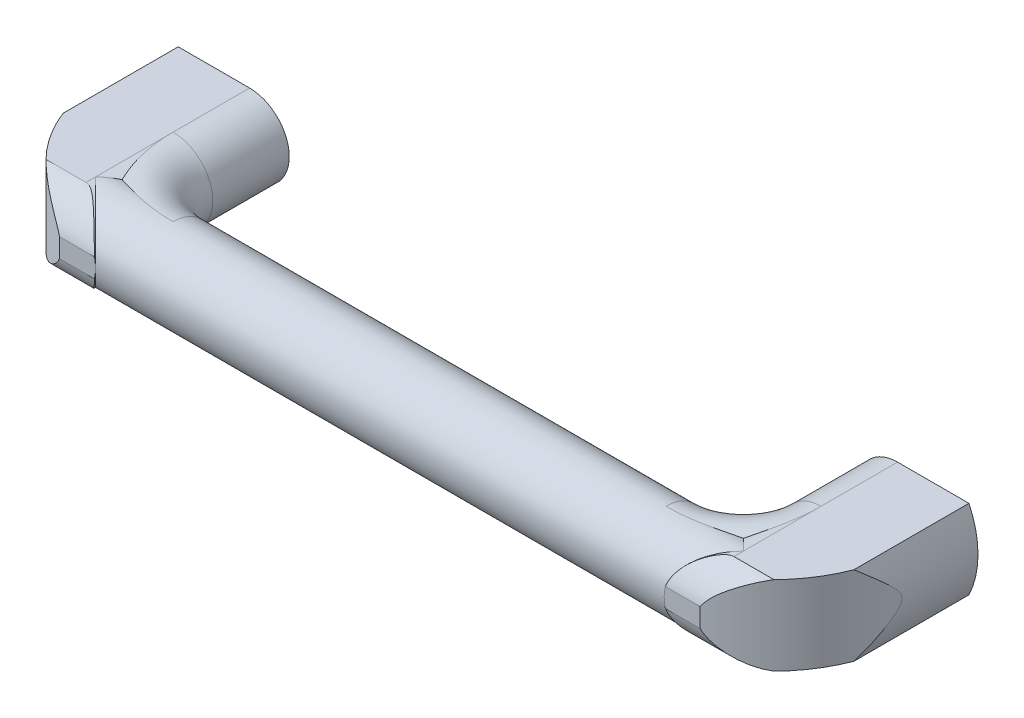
ISO-10303-21;
HEADER;
FILE_DESCRIPTION(('STEP AP214'),'2;1');
FILE_NAME('part.step','',(''),(''),'','','');
FILE_SCHEMA(('AUTOMOTIVE_DESIGN { 1 0 10303 214 1 1 1 1 }'));
ENDSEC;
DATA;
#1=APPLICATION_CONTEXT('core data for automotive mechanical design processes');
#2=APPLICATION_PROTOCOL_DEFINITION('international standard','automotive_design',2000,#1);
#3=PRODUCT_CONTEXT('',#1,'mechanical');
#4=PRODUCT('Part','Part','',(#3));
#5=PRODUCT_RELATED_PRODUCT_CATEGORY('part','',(#4));
#6=PRODUCT_DEFINITION_FORMATION('','',#4);
#7=PRODUCT_DEFINITION_CONTEXT('part definition',#1,'design');
#8=PRODUCT_DEFINITION('design','',#6,#7);
#9=PRODUCT_DEFINITION_SHAPE('','',#8);
#10=(LENGTH_UNIT() NAMED_UNIT(*) SI_UNIT(.MILLI.,.METRE.));
#11=(NAMED_UNIT(*) PLANE_ANGLE_UNIT() SI_UNIT($,.RADIAN.));
#12=(NAMED_UNIT(*) SI_UNIT($,.STERADIAN.) SOLID_ANGLE_UNIT());
#13=UNCERTAINTY_MEASURE_WITH_UNIT(LENGTH_MEASURE(1.E-05),#10,'distance_accuracy_value','');
#14=(GEOMETRIC_REPRESENTATION_CONTEXT(3) GLOBAL_UNCERTAINTY_ASSIGNED_CONTEXT((#13)) GLOBAL_UNIT_ASSIGNED_CONTEXT((#10,
#11,#12)) REPRESENTATION_CONTEXT('',''));
#15=CARTESIAN_POINT('',(0.,0.,0.));
#16=DIRECTION('',(0.,0.,1.));
#17=DIRECTION('',(1.,0.,0.));
#18=AXIS2_PLACEMENT_3D('',#15,#16,#17);
#19=CARTESIAN_POINT('',(279.5,-2.0404,15.));
#20=CARTESIAN_POINT('',(279.5,-2.,15.));
#21=CARTESIAN_POINT('',(279.5,2.,15.));
#22=CARTESIAN_POINT('',(279.5,2.04,15.));
#23=B_SPLINE_CURVE_WITH_KNOTS('',1,(#19,#20,#21,#22),.UNSPECIFIED.,.F.,.F.,(2,1,1,2),(-0.0101,
0.,1.,1.01),.UNSPECIFIED.);
#24=DIRECTION('',(1.,0.,0.));
#25=VECTOR('',#24,1.);
#26=SURFACE_OF_LINEAR_EXTRUSION('',#23,#25);
#27=CARTESIAN_POINT('',(281.5,0.,15.));
#28=DIRECTION('',(0.,0.,-1.));
#29=DIRECTION('',(0.,1.,0.));
#30=AXIS2_PLACEMENT_3D('',#27,#28,#29);
#31=CIRCLE('',#30,2.);
#32=CARTESIAN_POINT('',(281.5,2.,15.));
#33=VERTEX_POINT('',#32);
#34=EDGE_CURVE('E693',#33,#33,#31,.F.);
#35=ORIENTED_EDGE('',*,*,#34,.F.);
#36=EDGE_LOOP('',(#35));
#37=FACE_BOUND('',#36,.T.);
#38=ADVANCED_FACE('F14',(#37),#26,.T.);
#39=CARTESIAN_POINT('',(294.75,-5.35605,28.));
#40=CARTESIAN_POINT('',(294.75,-5.25,28.));
#41=CARTESIAN_POINT('',(294.75,5.25,28.));
#42=CARTESIAN_POINT('',(294.75,5.355,28.));
#43=B_SPLINE_CURVE_WITH_KNOTS('',1,(#39,#40,#41,#42),.UNSPECIFIED.,.F.,.F.,(2,1,1,2),(-0.0101,
0.,1.,1.01),.UNSPECIFIED.);
#44=DIRECTION('',(1.,0.,0.));
#45=VECTOR('',#44,1.);
#46=SURFACE_OF_LINEAR_EXTRUSION('',#43,#45);
#47=CARTESIAN_POINT('',(300.,0.,28.));
#48=DIRECTION('',(0.,0.,-1.));
#49=DIRECTION('',(0.,1.,0.));
#50=AXIS2_PLACEMENT_3D('',#47,#48,#49);
#51=CIRCLE('',#50,5.25);
#52=CARTESIAN_POINT('',(300.,5.25,28.));
#53=VERTEX_POINT('',#52);
#54=EDGE_CURVE('E181',#53,#53,#51,.F.);
#55=ORIENTED_EDGE('',*,*,#54,.F.);
#56=EDGE_LOOP('',(#55));
#57=FACE_BOUND('',#56,.T.);
#58=ADVANCED_FACE('F701',(#57),#46,.T.);
#59=CARTESIAN_POINT('',(281.5,0.,15.));
#60=DIRECTION('',(0.,0.,-1.));
#61=DIRECTION('',(0.,1.,0.));
#62=AXIS2_PLACEMENT_3D('',#59,#60,#61);
#63=CYLINDRICAL_SURFACE('',#62,2.);
#64=ORIENTED_EDGE('',*,*,#34,.T.);
#65=EDGE_LOOP('',(#64));
#66=FACE_BOUND('',#65,.T.);
#67=CARTESIAN_POINT('',(281.5,0.,0.));
#68=DIRECTION('',(0.,0.,-1.));
#69=DIRECTION('',(0.,1.,0.));
#70=AXIS2_PLACEMENT_3D('',#67,#68,#69);
#71=CIRCLE('',#70,2.);
#72=CARTESIAN_POINT('',(281.5,2.,0.));
#73=VERTEX_POINT('',#72);
#74=EDGE_CURVE('E1104',#73,#73,#71,.F.);
#75=ORIENTED_EDGE('',*,*,#74,.F.);
#76=EDGE_LOOP('',(#75));
#77=FACE_BOUND('',#76,.T.);
#78=ADVANCED_FACE('F703',(#66,#77),#63,.F.);
#79=CARTESIAN_POINT('',(300.,0.,28.));
#80=DIRECTION('',(0.,0.,-1.));
#81=DIRECTION('',(0.,1.,0.));
#82=AXIS2_PLACEMENT_3D('',#79,#80,#81);
#83=CYLINDRICAL_SURFACE('',#82,5.25);
#84=ORIENTED_EDGE('',*,*,#54,.T.);
#85=EDGE_LOOP('',(#84));
#86=FACE_BOUND('',#85,.T.);
#87=CARTESIAN_POINT('',(300.,0.,0.));
#88=DIRECTION('',(0.,0.,-1.));
#89=DIRECTION('',(0.,1.,0.));
#90=AXIS2_PLACEMENT_3D('',#87,#88,#89);
#91=CIRCLE('',#90,5.25);
#92=CARTESIAN_POINT('',(300.,5.25,0.));
#93=VERTEX_POINT('',#92);
#94=EDGE_CURVE('E238',#93,#93,#91,.F.);
#95=ORIENTED_EDGE('',*,*,#94,.F.);
#96=EDGE_LOOP('',(#95));
#97=FACE_BOUND('',#96,.T.);
#98=ADVANCED_FACE('F698',(#86,#97),#83,.F.);
#99=CARTESIAN_POINT('',(288.21875,0.,50.7942423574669));
#100=DIRECTION('',(0.,0.,1.));
#101=DIRECTION('',(0.,-1.,0.));
#102=AXIS2_PLACEMENT_3D('',#99,#100,#101);
#103=CYLINDRICAL_SURFACE('',#102,40.28125);
#104=DIRECTION('',(0.,0.,1.));
#105=VECTOR('',#104,1.);
#106=CARTESIAN_POINT('',(324.5,17.5,0.));
#107=LINE('',#106,#105);
#108=CARTESIAN_POINT('',(324.5,17.5,50.7940018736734));
#109=VERTEX_POINT('',#108);
#110=CARTESIAN_POINT('',(324.5,17.5,0.));
#111=VERTEX_POINT('',#110);
#112=EDGE_CURVE('E184',#109,#111,#107,.F.);
#113=ORIENTED_EDGE('',*,*,#112,.F.);
#114=CARTESIAN_POINT('',(324.5,-17.5,50.7940018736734));
#115=CARTESIAN_POINT('',(324.738211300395,-17.006085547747,50.1785950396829));
#116=CARTESIAN_POINT('',(324.965741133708,-16.5086445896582,49.5618980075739));
#117=CARTESIAN_POINT('',(325.39967641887,-15.5066550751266,48.3268031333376));
#118=CARTESIAN_POINT('',(325.606081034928,-15.0021062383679,47.7084052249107));
#119=CARTESIAN_POINT('',(325.99839856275,-13.9848147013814,46.4695330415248));
#120=CARTESIAN_POINT('',(326.184267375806,-13.472056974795,45.8490571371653));
#121=CARTESIAN_POINT('',(326.535195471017,-12.4389165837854,44.6086311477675));
#122=CARTESIAN_POINT('',(326.700255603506,-11.9185342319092,43.9886810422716));
#123=CARTESIAN_POINT('',(327.053691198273,-10.720104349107,42.5751415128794));
#124=CARTESIAN_POINT('',(327.235377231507,-10.0392477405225,41.7822358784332));
#125=CARTESIAN_POINT('',(327.482410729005,-9.00385682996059,40.6009813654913));
#126=CARTESIAN_POINT('',(327.560460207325,-8.65662365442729,40.2088523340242));
#127=CARTESIAN_POINT('',(327.708118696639,-7.95594403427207,39.4286121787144));
#128=CARTESIAN_POINT('',(327.777728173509,-7.60249793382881,39.0405008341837));
#129=CARTESIAN_POINT('',(327.923493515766,-6.80534757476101,38.1819438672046));
#130=CARTESIAN_POINT('',(327.997484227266,-6.35954856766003,37.7130489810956));
#131=CARTESIAN_POINT('',(328.098809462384,-5.67565482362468,37.0218067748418));
#132=CARTESIAN_POINT('',(328.131018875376,-5.44476979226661,36.79304727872));
#133=CARTESIAN_POINT('',(328.192091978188,-4.97663054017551,36.3417033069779));
#134=CARTESIAN_POINT('',(328.220956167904,-4.73937727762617,36.119117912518));
#135=CARTESIAN_POINT('',(328.270830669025,-4.29550662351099,35.7182711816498));
#136=CARTESIAN_POINT('',(328.292355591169,-4.09015903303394,35.5386746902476));
#137=CARTESIAN_POINT('',(328.332858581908,-3.67172875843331,35.1884913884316));
#138=CARTESIAN_POINT('',(328.351837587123,-3.45864895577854,35.0179012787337));
#139=CARTESIAN_POINT('',(328.387000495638,-3.02297958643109,34.6904473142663));
#140=CARTESIAN_POINT('',(328.403193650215,-2.80042468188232,34.5335389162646));
#141=CARTESIAN_POINT('',(328.432494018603,-2.34232030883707,34.2399732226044));
#142=CARTESIAN_POINT('',(328.445606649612,-2.10679456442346,34.103280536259));
#143=CARTESIAN_POINT('',(328.466693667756,-1.65138792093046,33.8772141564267));
#144=CARTESIAN_POINT('',(328.475115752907,-1.43348899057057,33.7839900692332));
#145=CARTESIAN_POINT('',(328.48854600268,-0.985949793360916,33.6328701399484));
#146=CARTESIAN_POINT('',(328.493569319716,-0.756366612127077,33.5748176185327));
#147=CARTESIAN_POINT('',(328.497724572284,-0.436893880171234,33.5265627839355));
#148=CARTESIAN_POINT('',(328.498575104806,-0.349847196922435,33.5166464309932));
#149=CARTESIAN_POINT('',(328.499713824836,-0.175217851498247,33.5033494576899));
#150=CARTESIAN_POINT('',(328.500001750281,-0.0876349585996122,33.4999718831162));
#151=CARTESIAN_POINT('',(328.499995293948,0.235627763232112,33.5000755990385));
#152=CARTESIAN_POINT('',(328.497896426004,0.471631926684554,33.5247720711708));
#153=CARTESIAN_POINT('',(328.489826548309,0.934777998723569,33.6178751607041));
#154=CARTESIAN_POINT('',(328.483842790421,1.16188811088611,33.6864256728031));
#155=CARTESIAN_POINT('',(328.464438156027,1.72707484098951,33.9022792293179));
#156=CARTESIAN_POINT('',(328.448729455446,2.05615934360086,34.0721850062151));
#157=CARTESIAN_POINT('',(328.420772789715,2.53014739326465,34.3581150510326));
#158=CARTESIAN_POINT('',(328.410685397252,2.68529771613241,34.4589466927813));
#159=CARTESIAN_POINT('',(328.38916231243,2.99004164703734,34.6685486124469));
#160=CARTESIAN_POINT('',(328.377727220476,3.13963769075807,34.777315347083));
#161=CARTESIAN_POINT('',(328.339401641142,3.60783061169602,35.1323000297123));
#162=CARTESIAN_POINT('',(328.31017721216,3.91785103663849,35.3894580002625));
#163=CARTESIAN_POINT('',(328.246352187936,4.52356671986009,35.9196194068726));
#164=CARTESIAN_POINT('',(328.211747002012,4.8192494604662,36.1926362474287));
#165=CARTESIAN_POINT('',(328.137321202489,5.40120423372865,36.7491632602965));
#166=CARTESIAN_POINT('',(328.0974883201,5.68745208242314,37.0326969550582));
#167=CARTESIAN_POINT('',(328.012788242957,6.25260994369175,37.6062748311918));
#168=CARTESIAN_POINT('',(327.967920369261,6.53151896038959,37.8963198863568));
#169=CARTESIAN_POINT('',(327.825448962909,7.36247178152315,38.7755265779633));
#170=CARTESIAN_POINT('',(327.720303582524,7.90623859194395,39.3712884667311));
#171=CARTESIAN_POINT('',(327.490306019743,8.97906901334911,40.5704342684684));
#172=CARTESIAN_POINT('',(327.365482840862,9.50815293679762,41.1738057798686));
#173=CARTESIAN_POINT('',(327.06333101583,10.683148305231,42.5316107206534));
#174=CARTESIAN_POINT('',(326.880608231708,11.3263109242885,43.2872290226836));
#175=CARTESIAN_POINT('',(326.484195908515,12.600792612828,44.8010374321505));
#176=CARTESIAN_POINT('',(326.27048917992,13.2321048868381,45.5592287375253));
#177=CARTESIAN_POINT('',(325.814880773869,14.4755882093,47.0651591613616));
#178=CARTESIAN_POINT('',(325.573388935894,15.0879019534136,47.8129040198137));
#179=CARTESIAN_POINT('',(325.188151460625,15.9984666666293,48.9326014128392));
#180=CARTESIAN_POINT('',(325.055945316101,16.3005883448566,49.3054113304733));
#181=CARTESIAN_POINT('',(324.783792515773,16.9022411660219,50.0502979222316));
#182=CARTESIAN_POINT('',(324.643845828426,17.2017722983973,50.4223745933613));
#183=CARTESIAN_POINT('',(324.5,17.5,50.7940018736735));
#184=B_SPLINE_CURVE_WITH_KNOTS('',3,(#114,#115,#116,#117,#118,#119,#120,#121,#122,#123,#124,
#125,#126,#127,#128,#129,#130,#131,#132,#133,#134,#135,#136,#137,#138,#139,#140,#141,#142,#143,
#144,#145,#146,#147,#148,#149,#150,#151,#152,#153,#154,#155,#156,#157,#158,#159,#160,#161,#162,
#163,#164,#165,#166,#167,#168,#169,#170,#171,#172,#173,#174,#175,#176,#177,#178,#179,#180,#181,
#182,#183),.UNSPECIFIED.,.F.,.F.,(4,2,2,2,2,2,2,2,2,2,2,2,2,2,2,2,2,2,2,2,2,2,2,2,2,2,2,2,2,2,2,
2,2,2,4),(0.,2.47271705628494,4.94553190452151,7.42355771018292,9.90148221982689,
13.0830631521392,14.6716299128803,16.260108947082,18.2132190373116,19.1929659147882,
20.1725661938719,20.9933370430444,21.8138051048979,22.6314936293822,23.4477332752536,
24.1572302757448,24.8635429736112,25.1261652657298,25.3889098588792,26.0953621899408,
26.8041445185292,27.909407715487,28.4653216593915,29.0209888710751,30.2314361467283,
31.4429218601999,32.6573034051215,33.8718488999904,36.3115270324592,38.7476423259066,
41.7739234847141,44.8018900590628,47.7898490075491,49.2830050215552,50.7761671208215),.UNSPECIFIED.);
#185=CARTESIAN_POINT('',(324.5,-17.5,50.7940018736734));
#186=VERTEX_POINT('',#185);
#187=EDGE_CURVE('E169',#186,#109,#184,.T.);
#188=ORIENTED_EDGE('',*,*,#187,.F.);
#189=DIRECTION('',(0.,0.,1.));
#190=VECTOR('',#189,1.);
#191=CARTESIAN_POINT('',(324.5,-17.5,0.));
#192=LINE('',#191,#190);
#193=CARTESIAN_POINT('',(324.5,-17.5,0.));
#194=VERTEX_POINT('',#193);
#195=EDGE_CURVE('E196',#194,#186,#192,.T.);
#196=ORIENTED_EDGE('',*,*,#195,.F.);
#197=CARTESIAN_POINT('',(288.21875,0.,0.));
#198=DIRECTION('',(0.,0.,1.));
#199=DIRECTION('',(0.,-1.,0.));
#200=AXIS2_PLACEMENT_3D('',#197,#198,#199);
#201=CIRCLE('',#200,40.28125);
#202=EDGE_CURVE('E180',#111,#194,#201,.F.);
#203=ORIENTED_EDGE('',*,*,#202,.F.);
#204=EDGE_LOOP('',(#113,#188,#196,#203));
#205=FACE_BOUND('',#204,.T.);
#206=ADVANCED_FACE('F185',(#205),#103,.T.);
#207=CARTESIAN_POINT('',(266.0214543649,17.5,28.1586722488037));
#208=DIRECTION('',(0.,1.,0.));
#209=DIRECTION('',(-1.,0.,0.));
#210=AXIS2_PLACEMENT_3D('',#207,#208,#209);
#211=CYLINDRICAL_SURFACE('',#210,62.7064466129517);
#212=CARTESIAN_POINT('',(310.645529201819,-17.5,72.2130748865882));
#213=CARTESIAN_POINT('',(310.300316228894,-17.4157967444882,72.5627639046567));
#214=CARTESIAN_POINT('',(309.952192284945,-17.3218132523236,72.907156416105));
#215=CARTESIAN_POINT('',(309.250923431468,-17.1153060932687,73.5849744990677));
#216=CARTESIAN_POINT('',(308.897779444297,-17.0027857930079,73.9184020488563));
#217=CARTESIAN_POINT('',(308.187326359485,-16.7602557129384,74.5738766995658));
#218=CARTESIAN_POINT('',(307.830019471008,-16.6302548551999,74.8959295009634));
#219=CARTESIAN_POINT('',(307.111798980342,-16.3535684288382,75.5286121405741));
#220=CARTESIAN_POINT('',(306.750885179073,-16.206881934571,75.8392413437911));
#221=CARTESIAN_POINT('',(305.641760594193,-15.7335268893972,76.7722605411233));
#222=CARTESIAN_POINT('',(304.888623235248,-15.3809239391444,77.3760155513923));
#223=CARTESIAN_POINT('',(303.754618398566,-14.8048036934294,78.2439386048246));
#224=CARTESIAN_POINT('',(303.375852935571,-14.6048664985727,78.5269942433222));
#225=CARTESIAN_POINT('',(302.617656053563,-14.1894813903,79.0805398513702));
#226=CARTESIAN_POINT('',(302.238224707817,-13.9740350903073,79.3510311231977));
#227=CARTESIAN_POINT('',(301.472912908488,-13.5238089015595,79.8840417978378));
#228=CARTESIAN_POINT('',(301.087037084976,-13.2887544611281,80.1463355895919));
#229=CARTESIAN_POINT('',(300.316645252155,-12.8025823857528,80.657739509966));
#230=CARTESIAN_POINT('',(299.932129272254,-12.5514644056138,80.9068493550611));
#231=CARTESIAN_POINT('',(299.165360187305,-12.0324960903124,81.3919887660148));
#232=CARTESIAN_POINT('',(298.783109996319,-11.7646278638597,81.6280038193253));
#233=CARTESIAN_POINT('',(298.022923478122,-11.2116864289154,82.0864144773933));
#234=CARTESIAN_POINT('',(297.64498692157,-10.9266141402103,82.3088108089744));
#235=CARTESIAN_POINT('',(296.901475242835,-10.3428222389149,82.7361734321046));
#236=CARTESIAN_POINT('',(296.53579908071,-10.0443947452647,82.9413620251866));
#237=CARTESIAN_POINT('',(295.813096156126,-9.42809164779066,83.3377111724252));
#238=CARTESIAN_POINT('',(295.456071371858,-9.11021165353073,83.5288685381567));
#239=CARTESIAN_POINT('',(294.755113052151,-8.4536129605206,83.895836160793));
#240=CARTESIAN_POINT('',(294.411152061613,-8.11494238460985,84.0716797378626));
#241=CARTESIAN_POINT('',(293.740630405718,-7.4133774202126,84.4071023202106));
#242=CARTESIAN_POINT('',(293.414058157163,-7.05049952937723,84.5666922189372));
#243=CARTESIAN_POINT('',(292.942300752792,-6.48469370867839,84.7925592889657));
#244=CARTESIAN_POINT('',(292.78784257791,-6.29219900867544,84.8656969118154));
#245=CARTESIAN_POINT('',(292.486468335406,-5.89969702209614,85.0069715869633));
#246=CARTESIAN_POINT('',(292.339549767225,-5.69969226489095,85.0751103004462));
#247=CARTESIAN_POINT('',(292.053898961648,-5.29043821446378,85.206328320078));
#248=CARTESIAN_POINT('',(291.915218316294,-5.08114261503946,85.2693764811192));
#249=CARTESIAN_POINT('',(291.648836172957,-4.65377021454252,85.3894098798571));
#250=CARTESIAN_POINT('',(291.521143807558,-4.4356863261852,85.4463900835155));
#251=CARTESIAN_POINT('',(291.4,-4.21307488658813,85.5));
#252=B_SPLINE_CURVE_WITH_KNOTS('',3,(#212,#213,#214,#215,#216,#217,#218,#219,#220,#221,#222,
#223,#224,#225,#226,#227,#228,#229,#230,#231,#232,#233,#234,#235,#236,#237,#238,#239,#240,#241,
#242,#243,#244,#245,#246,#247,#248,#249,#250,#251),.UNSPECIFIED.,.F.,.F.,(4,2,2,2,2,2,2,2,2,2,2,
2,2,2,2,2,2,2,2,4),(0.,1.49542286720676,2.99057443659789,4.48496575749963,5.97944002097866,
9.05839502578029,10.5982556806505,12.1379563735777,13.7048892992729,15.2718559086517,
16.8405258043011,18.4091119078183,19.9525466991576,21.4963311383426,23.036667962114,
24.575965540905,25.3479819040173,26.1197405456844,26.8959104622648,27.6727193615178),.UNSPECIFIED.);
#253=CARTESIAN_POINT('',(310.645529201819,-17.5,72.2130748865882));
#254=VERTEX_POINT('',#253);
#255=CARTESIAN_POINT('',(291.4,-4.21307488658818,85.5));
#256=VERTEX_POINT('',#255);
#257=EDGE_CURVE('E230',#254,#256,#252,.T.);
#258=ORIENTED_EDGE('',*,*,#257,.F.);
#259=CARTESIAN_POINT('',(266.0214543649,-17.5,28.1586722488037));
#260=DIRECTION('',(0.,1.,0.));
#261=DIRECTION('',(-1.,0.,0.));
#262=AXIS2_PLACEMENT_3D('',#259,#260,#261);
#263=CIRCLE('',#262,62.7064466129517);
#264=EDGE_CURVE('E176',#186,#254,#263,.F.);
#265=ORIENTED_EDGE('',*,*,#264,.F.);
#266=ORIENTED_EDGE('',*,*,#187,.T.);
#267=CARTESIAN_POINT('',(266.0214543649,17.5,28.1586722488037));
#268=DIRECTION('',(0.,1.,0.));
#269=DIRECTION('',(-1.,0.,0.));
#270=AXIS2_PLACEMENT_3D('',#267,#268,#269);
#271=CIRCLE('',#270,62.7064466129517);
#272=CARTESIAN_POINT('',(310.645529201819,17.5,72.2130748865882));
#273=VERTEX_POINT('',#272);
#274=EDGE_CURVE('E173',#273,#109,#271,.T.);
#275=ORIENTED_EDGE('',*,*,#274,.F.);
#276=CARTESIAN_POINT('',(291.4,4.21307488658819,85.5));
#277=CARTESIAN_POINT('',(291.539557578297,4.46946065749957,85.438245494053));
#278=CARTESIAN_POINT('',(291.687742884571,4.7198229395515,85.3720407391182));
#279=CARTESIAN_POINT('',(291.998250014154,5.20889941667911,85.2317230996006));
#280=CARTESIAN_POINT('',(292.160554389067,5.44762743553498,85.1576199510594));
#281=CARTESIAN_POINT('',(292.495744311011,5.91335693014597,85.0027084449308));
#282=CARTESIAN_POINT('',(292.668576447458,6.14040832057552,84.9219332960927));
#283=CARTESIAN_POINT('',(293.02343282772,6.58484484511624,84.7539918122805));
#284=CARTESIAN_POINT('',(293.205460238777,6.80222659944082,84.6668232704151));
#285=CARTESIAN_POINT('',(293.759688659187,7.43761351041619,84.3979473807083));
#286=CARTESIAN_POINT('',(294.142756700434,7.84253109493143,84.2076220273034));
#287=CARTESIAN_POINT('',(294.928733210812,8.6227698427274,83.8063415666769));
#288=CARTESIAN_POINT('',(295.331672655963,8.99804226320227,83.5953537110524));
#289=CARTESIAN_POINT('',(296.086152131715,9.66507183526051,83.1892639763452));
#290=CARTESIAN_POINT('',(296.435787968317,9.96067161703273,82.9968966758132));
#291=CARTESIAN_POINT('',(297.14180876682,10.5347634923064,82.5993385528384));
#292=CARTESIAN_POINT('',(297.498194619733,10.8132533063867,82.39414602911));
#293=CARTESIAN_POINT('',(298.215654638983,11.3542474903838,81.9713595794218));
#294=CARTESIAN_POINT('',(298.576728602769,11.6167525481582,81.7537661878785));
#295=CARTESIAN_POINT('',(299.302012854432,12.126575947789,81.3064324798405));
#296=CARTESIAN_POINT('',(299.666222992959,12.373895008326,81.0766927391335));
#297=CARTESIAN_POINT('',(300.399153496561,12.8555676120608,80.6035374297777));
#298=CARTESIAN_POINT('',(300.76788749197,13.0898158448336,80.3600358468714));
#299=CARTESIAN_POINT('',(301.506219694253,13.5436682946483,79.8609782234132));
#300=CARTESIAN_POINT('',(301.875817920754,13.763272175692,79.6054219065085));
#301=CARTESIAN_POINT('',(302.614852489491,14.1878015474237,79.0824047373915));
#302=CARTESIAN_POINT('',(302.9842888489,14.3927308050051,78.814946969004));
#303=CARTESIAN_POINT('',(303.722266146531,14.7878052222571,78.2681343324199));
#304=CARTESIAN_POINT('',(304.090807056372,14.9779499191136,77.9887790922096));
#305=CARTESIAN_POINT('',(304.989486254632,15.4241962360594,77.2915774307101));
#306=CARTESIAN_POINT('',(305.51874156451,15.6721110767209,76.8672983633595));
#307=CARTESIAN_POINT('',(306.571426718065,16.1348068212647,75.9944919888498));
#308=CARTESIAN_POINT('',(307.094858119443,16.3495967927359,75.545971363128));
#309=CARTESIAN_POINT('',(308.128522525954,16.7419087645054,74.6297927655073));
#310=CARTESIAN_POINT('',(308.638836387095,16.9197981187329,74.1623849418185));
#311=CARTESIAN_POINT('',(309.397056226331,17.1588063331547,73.4441775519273));
#312=CARTESIAN_POINT('',(309.648669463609,17.2338582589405,73.2018430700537));
#313=CARTESIAN_POINT('',(310.149193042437,17.3742843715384,72.7116055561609));
#314=CARTESIAN_POINT('',(310.398103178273,17.4396578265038,72.4637021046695));
#315=CARTESIAN_POINT('',(310.645529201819,17.5,72.2130748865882));
#316=B_SPLINE_CURVE_WITH_KNOTS('',3,(#276,#277,#278,#279,#280,#281,#282,#283,#284,#285,#286,
#287,#288,#289,#290,#291,#292,#293,#294,#295,#296,#297,#298,#299,#300,#301,#302,#303,#304,#305,
#306,#307,#308,#309,#310,#311,#312,#313,#314,#315),.UNSPECIFIED.,.F.,.F.,(4,2,2,2,2,2,2,2,2,2,2,
2,2,2,2,2,2,2,2,4),(0.,0.894568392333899,1.78804656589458,2.67731847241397,3.5668987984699,
5.33190373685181,7.09975278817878,8.5890676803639,10.0785805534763,11.5680292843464,
13.0574074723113,14.5574314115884,16.0574897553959,17.55716165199,19.0568804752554,
21.2222891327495,23.3871039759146,25.5292067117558,26.6009652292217,27.6728047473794),.UNSPECIFIED.);
#317=CARTESIAN_POINT('',(291.4,4.21307488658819,85.5));
#318=VERTEX_POINT('',#317);
#319=EDGE_CURVE('E194',#318,#273,#316,.T.);
#320=ORIENTED_EDGE('',*,*,#319,.F.);
#321=DIRECTION('',(0.,1.,0.));
#322=VECTOR('',#321,1.);
#323=CARTESIAN_POINT('',(291.4,0.,85.5));
#324=LINE('',#323,#322);
#325=EDGE_CURVE('E346',#256,#318,#324,.T.);
#326=ORIENTED_EDGE('',*,*,#325,.F.);
#327=EDGE_LOOP('',(#258,#265,#266,#275,#320,#326));
#328=FACE_BOUND('',#327,.T.);
#329=ADVANCED_FACE('F171',(#328),#211,.T.);
#330=CARTESIAN_POINT('',(16.5,-2.0404,15.));
#331=CARTESIAN_POINT('',(16.5,-2.,15.));
#332=CARTESIAN_POINT('',(16.5,2.,15.));
#333=CARTESIAN_POINT('',(16.5,2.04,15.));
#334=B_SPLINE_CURVE_WITH_KNOTS('',1,(#330,#331,#332,#333),.UNSPECIFIED.,.F.,.F.,(2,1,1,2),
(-0.0101,0.,1.,1.01),.UNSPECIFIED.);
#335=DIRECTION('',(1.,0.,0.));
#336=VECTOR('',#335,1.);
#337=SURFACE_OF_LINEAR_EXTRUSION('',#334,#336);
#338=CARTESIAN_POINT('',(18.5,0.,15.));
#339=DIRECTION('',(0.,0.,-1.));
#340=DIRECTION('',(0.,1.,0.));
#341=AXIS2_PLACEMENT_3D('',#338,#339,#340);
#342=CIRCLE('',#341,2.);
#343=CARTESIAN_POINT('',(18.5,2.,15.));
#344=VERTEX_POINT('',#343);
#345=EDGE_CURVE('E199',#344,#344,#342,.F.);
#346=ORIENTED_EDGE('',*,*,#345,.F.);
#347=EDGE_LOOP('',(#346));
#348=FACE_BOUND('',#347,.T.);
#349=ADVANCED_FACE('F217',(#348),#337,.T.);
#350=CARTESIAN_POINT('',(-5.25,-5.35605,28.));
#351=CARTESIAN_POINT('',(-5.25,-5.25,28.));
#352=CARTESIAN_POINT('',(-5.25,5.25,28.));
#353=CARTESIAN_POINT('',(-5.25,5.355,28.));
#354=B_SPLINE_CURVE_WITH_KNOTS('',1,(#350,#351,#352,#353),.UNSPECIFIED.,.F.,.F.,(2,1,1,2),
(-0.0101,0.,1.,1.01),.UNSPECIFIED.);
#355=DIRECTION('',(1.,0.,0.));
#356=VECTOR('',#355,1.);
#357=SURFACE_OF_LINEAR_EXTRUSION('',#354,#356);
#358=CARTESIAN_POINT('',(0.,0.,28.));
#359=DIRECTION('',(0.,0.,-1.));
#360=DIRECTION('',(0.,1.,0.));
#361=AXIS2_PLACEMENT_3D('',#358,#359,#360);
#362=CIRCLE('',#361,5.25);
#363=CARTESIAN_POINT('',(0.,5.25,28.));
#364=VERTEX_POINT('',#363);
#365=EDGE_CURVE('E463',#364,#364,#362,.F.);
#366=ORIENTED_EDGE('',*,*,#365,.F.);
#367=EDGE_LOOP('',(#366));
#368=FACE_BOUND('',#367,.T.);
#369=ADVANCED_FACE('F897',(#368),#357,.T.);
#370=CARTESIAN_POINT('',(275.5,-17.5,0.));
#371=CARTESIAN_POINT('',(275.5,17.5,0.));
#372=B_SPLINE_CURVE_WITH_KNOTS('',1,(#370,#371),.UNSPECIFIED.,.F.,.F.,(2,2),(0.,1.),.UNSPECIFIED.);
#373=DIRECTION('',(1.,0.,0.));
#374=VECTOR('',#373,1.);
#375=SURFACE_OF_LINEAR_EXTRUSION('',#372,#374);
#376=ORIENTED_EDGE('',*,*,#94,.T.);
#377=EDGE_LOOP('',(#376));
#378=FACE_BOUND('',#377,.T.);
#379=ORIENTED_EDGE('',*,*,#74,.T.);
#380=EDGE_LOOP('',(#379));
#381=FACE_BOUND('',#380,.T.);
#382=ORIENTED_EDGE('',*,*,#202,.T.);
#383=DIRECTION('',(1.,0.,0.));
#384=VECTOR('',#383,1.);
#385=CARTESIAN_POINT('',(308.75,-17.5,0.));
#386=LINE('',#385,#384);
#387=CARTESIAN_POINT('',(293.,-17.5,0.));
#388=VERTEX_POINT('',#387);
#389=EDGE_CURVE('E355',#388,#194,#386,.T.);
#390=ORIENTED_EDGE('',*,*,#389,.F.);
#391=CARTESIAN_POINT('',(293.,0.,0.));
#392=DIRECTION('',(0.,0.,1.));
#393=DIRECTION('',(0.,-1.,0.));
#394=AXIS2_PLACEMENT_3D('',#391,#392,#393);
#395=CIRCLE('',#394,17.5);
#396=CARTESIAN_POINT('',(293.,17.5,0.));
#397=VERTEX_POINT('',#396);
#398=EDGE_CURVE('E415',#397,#388,#395,.T.);
#399=ORIENTED_EDGE('',*,*,#398,.F.);
#400=DIRECTION('',(-1.,0.,0.));
#401=VECTOR('',#400,1.);
#402=CARTESIAN_POINT('',(308.75,17.5,0.));
#403=LINE('',#402,#401);
#404=EDGE_CURVE('E188',#111,#397,#403,.T.);
#405=ORIENTED_EDGE('',*,*,#404,.F.);
#406=EDGE_LOOP('',(#382,#390,#399,#405));
#407=FACE_BOUND('',#406,.T.);
#408=ADVANCED_FACE('F889',(#378,#381,#407),#375,.T.);
#409=CARTESIAN_POINT('',(8.6,4.2130748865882,85.5));
#410=CARTESIAN_POINT('',(8.6,-4.21307488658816,85.5));
#411=B_SPLINE_CURVE_WITH_KNOTS('',1,(#409,#410),.UNSPECIFIED.,.F.,.F.,(2,2),(0.,1.),.UNSPECIFIED.);
#412=DIRECTION('',(1.,0.,0.));
#413=VECTOR('',#412,1.);
#414=SURFACE_OF_LINEAR_EXTRUSION('',#411,#413);
#415=CARTESIAN_POINT('',(7.,0.,85.5));
#416=DIRECTION('',(0.,0.,1.));
#417=DIRECTION('',(0.,-1.,0.));
#418=AXIS2_PLACEMENT_3D('',#415,#416,#417);
#419=CIRCLE('',#418,17.5);
#420=CARTESIAN_POINT('',(23.985287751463,4.21307488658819,85.5));
#421=VERTEX_POINT('',#420);
#422=CARTESIAN_POINT('',(24.5,0.,85.5));
#423=VERTEX_POINT('',#422);
#424=EDGE_CURVE('E482',#421,#423,#419,.F.);
#425=ORIENTED_EDGE('',*,*,#424,.F.);
#426=DIRECTION('',(1.,0.,0.));
#427=VECTOR('',#426,1.);
#428=CARTESIAN_POINT('',(6.66991294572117,4.21307488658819,85.5));
#429=LINE('',#428,#427);
#430=CARTESIAN_POINT('',(8.6,4.21307488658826,85.5));
#431=VERTEX_POINT('',#430);
#432=EDGE_CURVE('E359',#431,#421,#429,.T.);
#433=ORIENTED_EDGE('',*,*,#432,.F.);
#434=DIRECTION('',(0.,1.,0.));
#435=VECTOR('',#434,1.);
#436=CARTESIAN_POINT('',(8.6,0.,85.5));
#437=LINE('',#436,#435);
#438=CARTESIAN_POINT('',(8.6,-4.21307488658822,85.5));
#439=VERTEX_POINT('',#438);
#440=EDGE_CURVE('E350',#439,#431,#437,.T.);
#441=ORIENTED_EDGE('',*,*,#440,.F.);
#442=DIRECTION('',(-1.,0.,0.));
#443=VECTOR('',#442,1.);
#444=CARTESIAN_POINT('',(6.6699129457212,-4.21307488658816,85.5));
#445=LINE('',#444,#443);
#446=CARTESIAN_POINT('',(23.985287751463,-4.21307488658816,85.5));
#447=VERTEX_POINT('',#446);
#448=EDGE_CURVE('E362',#447,#439,#445,.T.);
#449=ORIENTED_EDGE('',*,*,#448,.F.);
#450=CARTESIAN_POINT('',(7.,0.,85.5));
#451=DIRECTION('',(0.,0.,1.));
#452=DIRECTION('',(0.,-1.,0.));
#453=AXIS2_PLACEMENT_3D('',#450,#451,#452);
#454=CIRCLE('',#453,17.5);
#455=EDGE_CURVE('E481',#423,#447,#454,.F.);
#456=ORIENTED_EDGE('',*,*,#455,.F.);
#457=EDGE_LOOP('',(#425,#433,#441,#449,#456));
#458=FACE_BOUND('',#457,.T.);
#459=ADVANCED_FACE('F245',(#458),#414,.T.);
#460=CARTESIAN_POINT('',(276.014243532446,0.,68.));
#461=DIRECTION('',(-1.,0.,0.));
#462=DIRECTION('',(0.,0.,-1.));
#463=AXIS2_PLACEMENT_3D('',#460,#461,#462);
#464=CYLINDRICAL_SURFACE('',#463,18.);
#465=CARTESIAN_POINT('',(293.,-17.5,72.2130748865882));
#466=CARTESIAN_POINT('',(292.854161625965,-17.500022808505,72.2129035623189));
#467=CARTESIAN_POINT('',(292.708447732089,-17.4981780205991,72.2206441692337));
#468=CARTESIAN_POINT('',(292.419047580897,-17.490945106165,72.2505577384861));
#469=CARTESIAN_POINT('',(292.275356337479,-17.4855683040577,72.2726845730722));
#470=CARTESIAN_POINT('',(291.993842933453,-17.4716102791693,72.3293889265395));
#471=CARTESIAN_POINT('',(291.855960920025,-17.4630992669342,72.3636930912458));
#472=CARTESIAN_POINT('',(291.58343199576,-17.4431077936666,72.4429355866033));
#473=CARTESIAN_POINT('',(291.448787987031,-17.4316247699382,72.4878830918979));
#474=CARTESIAN_POINT('',(291.093372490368,-17.3972639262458,72.6197862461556));
#475=CARTESIAN_POINT('',(290.875775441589,-17.3719249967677,72.7146253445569));
#476=CARTESIAN_POINT('',(290.449780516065,-17.3145215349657,72.9212672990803));
#477=CARTESIAN_POINT('',(290.241390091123,-17.2824516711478,73.0330835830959));
#478=CARTESIAN_POINT('',(289.829592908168,-17.2117038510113,73.2699857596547));
#479=CARTESIAN_POINT('',(289.626295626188,-17.1729402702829,73.3952344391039));
#480=CARTESIAN_POINT('',(289.226395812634,-17.0895170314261,73.6539293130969));
#481=CARTESIAN_POINT('',(289.029791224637,-17.0448592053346,73.7873729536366));
#482=CARTESIAN_POINT('',(288.539288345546,-16.9246982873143,74.1321456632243));
#483=CARTESIAN_POINT('',(288.249012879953,-16.8453859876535,74.3472912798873));
#484=CARTESIAN_POINT('',(287.678126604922,-16.6738246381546,74.7852073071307));
#485=CARTESIAN_POINT('',(287.397519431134,-16.5815707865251,75.0079805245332));
#486=CARTESIAN_POINT('',(286.843934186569,-16.3841172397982,75.4579592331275));
#487=CARTESIAN_POINT('',(286.570965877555,-16.2789018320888,75.6851698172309));
#488=CARTESIAN_POINT('',(286.031947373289,-16.0555699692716,76.1414512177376));
#489=CARTESIAN_POINT('',(285.765897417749,-15.9374530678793,76.3705220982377));
#490=CARTESIAN_POINT('',(285.241030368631,-15.6886087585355,76.8280887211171));
#491=CARTESIAN_POINT('',(284.982191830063,-15.5579254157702,77.0565837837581));
#492=CARTESIAN_POINT('',(284.470597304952,-15.2834398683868,77.5124815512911));
#493=CARTESIAN_POINT('',(284.217841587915,-15.1396370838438,77.7398842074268));
#494=CARTESIAN_POINT('',(283.469044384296,-14.6884499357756,78.418455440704));
#495=CARTESIAN_POINT('',(282.981936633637,-14.3610332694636,78.866459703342));
#496=CARTESIAN_POINT('',(282.13088136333,-13.7234881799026,79.6562594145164));
#497=CARTESIAN_POINT('',(281.76209709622,-13.4234840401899,80.0010606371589));
#498=CARTESIAN_POINT('',(281.043168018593,-12.787282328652,80.67677813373));
#499=CARTESIAN_POINT('',(280.693025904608,-12.4510795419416,81.0076923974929));
#500=CARTESIAN_POINT('',(280.014574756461,-11.7417817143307,81.6513673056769));
#501=CARTESIAN_POINT('',(279.686252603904,-11.3687091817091,81.9641388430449));
#502=CARTESIAN_POINT('',(279.054997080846,-10.5848903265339,82.5672380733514));
#503=CARTESIAN_POINT('',(278.75205430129,-10.1741580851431,82.8575740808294));
#504=CARTESIAN_POINT('',(278.246667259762,-9.42027740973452,83.3429847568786));
#505=CARTESIAN_POINT('',(278.037787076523,-9.08523093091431,83.5439690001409));
#506=CARTESIAN_POINT('',(277.639276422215,-8.39388580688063,83.9279308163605));
#507=CARTESIAN_POINT('',(277.449647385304,-8.03758558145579,84.1109070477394));
#508=CARTESIAN_POINT('',(277.092693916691,-7.30567712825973,84.455706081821));
#509=CARTESIAN_POINT('',(276.925305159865,-6.93012913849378,84.617589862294));
#510=CARTESIAN_POINT('',(276.614867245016,-6.16030984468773,84.9180688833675));
#511=CARTESIAN_POINT('',(276.471801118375,-5.76605184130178,85.0566803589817));
#512=CARTESIAN_POINT('',(276.281563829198,-5.17523658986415,85.2411104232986));
#513=CARTESIAN_POINT('',(276.223878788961,-4.98513070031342,85.2970536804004));
#514=CARTESIAN_POINT('',(276.114640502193,-4.60156406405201,85.4030224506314));
#515=CARTESIAN_POINT('',(276.063086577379,-4.4081036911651,85.4530486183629));
#516=CARTESIAN_POINT('',(276.014712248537,-4.21307488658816,85.5));
#517=B_SPLINE_CURVE_WITH_KNOTS('',3,(#465,#466,#467,#468,#469,#470,#471,#472,#473,#474,#475,
#476,#477,#478,#479,#480,#481,#482,#483,#484,#485,#486,#487,#488,#489,#490,#491,#492,#493,#494,
#495,#496,#497,#498,#499,#500,#501,#502,#503,#504,#505,#506,#507,#508,#509,#510,#511,#512,#513,
#514,#515,#516),.UNSPECIFIED.,.F.,.F.,(4,2,2,2,2,2,2,2,2,2,2,2,2,2,2,2,2,2,2,2,2,2,2,2,2,4),(0.,
0.437099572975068,0.872804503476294,1.29929022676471,1.72614493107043,2.44096272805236,
3.15634887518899,3.88167490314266,4.60677601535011,5.71593426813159,6.82550515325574,
7.93643459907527,9.04740248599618,10.1546076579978,11.2618617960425,13.474101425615,
15.2345629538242,16.9952784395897,18.7549256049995,20.5139174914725,21.8418802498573,
23.16994186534,24.4940746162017,25.8172797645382,26.4362792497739,27.0552101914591),.UNSPECIFIED.);
#518=CARTESIAN_POINT('',(293.,-17.5,72.2130748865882));
#519=VERTEX_POINT('',#518);
#520=CARTESIAN_POINT('',(276.014712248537,-4.21307488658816,85.5));
#521=VERTEX_POINT('',#520);
#522=EDGE_CURVE('E252',#519,#521,#517,.T.);
#523=ORIENTED_EDGE('',*,*,#522,.F.);
#524=DIRECTION('',(-1.,0.,0.));
#525=VECTOR('',#524,1.);
#526=CARTESIAN_POINT('',(308.75,-17.5,72.2130748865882));
#527=LINE('',#526,#525);
#528=EDGE_CURVE('E358',#254,#519,#527,.T.);
#529=ORIENTED_EDGE('',*,*,#528,.F.);
#530=ORIENTED_EDGE('',*,*,#257,.T.);
#531=DIRECTION('',(1.,0.,0.));
#532=VECTOR('',#531,1.);
#533=CARTESIAN_POINT('',(275.5,-4.21307488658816,85.5));
#534=LINE('',#533,#532);
#535=EDGE_CURVE('E364',#521,#256,#534,.T.);
#536=ORIENTED_EDGE('',*,*,#535,.F.);
#537=EDGE_LOOP('',(#523,#529,#530,#536));
#538=FACE_BOUND('',#537,.T.);
#539=ADVANCED_FACE('F240',(#538),#464,.T.);
#540=CARTESIAN_POINT('',(293.,-17.5,0.));
#541=CARTESIAN_POINT('',(324.5,-17.5,0.));
#542=B_SPLINE_CURVE_WITH_KNOTS('',1,(#540,#541),.UNSPECIFIED.,.F.,.F.,(2,2),(0.,1.),.UNSPECIFIED.);
#543=DIRECTION('',(0.,0.,1.));
#544=VECTOR('',#543,1.);
#545=SURFACE_OF_LINEAR_EXTRUSION('',#542,#544);
#546=ORIENTED_EDGE('',*,*,#389,.T.);
#547=ORIENTED_EDGE('',*,*,#195,.T.);
#548=ORIENTED_EDGE('',*,*,#264,.T.);
#549=ORIENTED_EDGE('',*,*,#528,.T.);
#550=DIRECTION('',(0.,0.,1.));
#551=VECTOR('',#550,1.);
#552=CARTESIAN_POINT('',(293.,-17.5,76.7502343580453));
#553=LINE('',#552,#551);
#554=CARTESIAN_POINT('',(293.,-17.5,68.));
#555=VERTEX_POINT('',#554);
#556=EDGE_CURVE('E290',#555,#519,#553,.T.);
#557=ORIENTED_EDGE('',*,*,#556,.F.);
#558=DIRECTION('',(0.,0.,1.));
#559=VECTOR('',#558,1.);
#560=CARTESIAN_POINT('',(293.,-17.5,50.8745260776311));
#561=LINE('',#560,#559);
#562=CARTESIAN_POINT('',(293.,-17.5,33.75));
#563=VERTEX_POINT('',#562);
#564=EDGE_CURVE('E414',#563,#555,#561,.T.);
#565=ORIENTED_EDGE('',*,*,#564,.F.);
#566=DIRECTION('',(0.,0.,1.));
#567=VECTOR('',#566,1.);
#568=CARTESIAN_POINT('',(293.,-17.5,16.875));
#569=LINE('',#568,#567);
#570=EDGE_CURVE('E406',#388,#563,#569,.T.);
#571=ORIENTED_EDGE('',*,*,#570,.F.);
#572=EDGE_LOOP('',(#546,#547,#548,#549,#557,#565,#571));
#573=FACE_BOUND('',#572,.T.);
#574=ADVANCED_FACE('F244',(#573),#545,.T.);
#575=CARTESIAN_POINT('',(276.014243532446,0.,68.));
#576=DIRECTION('',(-1.,0.,0.));
#577=DIRECTION('',(0.,-1.,0.));
#578=AXIS2_PLACEMENT_3D('',#575,#576,#577);
#579=CYLINDRICAL_SURFACE('',#578,18.);
#580=CARTESIAN_POINT('',(276.014712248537,4.21307488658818,85.5));
#581=CARTESIAN_POINT('',(276.070314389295,4.43724994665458,85.4460335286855));
#582=CARTESIAN_POINT('',(276.130118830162,4.65934783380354,85.3880031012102));
#583=CARTESIAN_POINT('',(276.257754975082,5.09898054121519,85.2641978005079));
#584=CARTESIAN_POINT('',(276.325584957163,5.31651632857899,85.1984245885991));
#585=CARTESIAN_POINT('',(276.540298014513,5.96094620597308,84.9903074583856));
#586=CARTESIAN_POINT('',(276.698630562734,6.3805662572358,84.8369462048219));
#587=CARTESIAN_POINT('',(277.040514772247,7.1928371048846,84.5061601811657));
#588=CARTESIAN_POINT('',(277.223753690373,7.58574362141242,84.3290341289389));
#589=CARTESIAN_POINT('',(277.613858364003,8.34867125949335,83.9524531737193));
#590=CARTESIAN_POINT('',(277.820736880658,8.71867985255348,83.7529862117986));
#591=CARTESIAN_POINT('',(278.303445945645,9.51437263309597,83.2883455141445));
#592=CARTESIAN_POINT('',(278.584387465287,9.93417855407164,83.0184159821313));
#593=CARTESIAN_POINT('',(279.172542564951,10.7377589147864,82.4548091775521));
#594=CARTESIAN_POINT('',(279.479759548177,11.1215286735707,82.1611288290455));
#595=CARTESIAN_POINT('',(280.118427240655,11.8555091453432,81.5526897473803));
#596=CARTESIAN_POINT('',(280.450006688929,12.2055150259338,81.2378199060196));
#597=CARTESIAN_POINT('',(281.132625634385,12.8702133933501,80.5925468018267));
#598=CARTESIAN_POINT('',(281.483664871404,13.1849063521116,80.2621437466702));
#599=CARTESIAN_POINT('',(282.323213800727,13.8796434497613,79.476698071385));
#600=CARTESIAN_POINT('',(282.818428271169,14.2463346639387,79.0169336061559));
#601=CARTESIAN_POINT('',(283.58133469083,14.7523515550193,78.3175141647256));
#602=CARTESIAN_POINT('',(283.839111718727,14.913753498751,78.0826314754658));
#603=CARTESIAN_POINT('',(284.361244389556,15.2221499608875,77.610700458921));
#604=CARTESIAN_POINT('',(284.625599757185,15.3691450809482,77.3736522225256));
#605=CARTESIAN_POINT('',(285.160216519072,15.6485957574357,76.8992718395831));
#606=CARTESIAN_POINT('',(285.430460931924,15.7810878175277,76.6619420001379));
#607=CARTESIAN_POINT('',(285.977861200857,16.032163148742,76.187896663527));
#608=CARTESIAN_POINT('',(286.255016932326,16.1507466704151,75.9511811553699));
#609=CARTESIAN_POINT('',(286.816728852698,16.3740168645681,75.4805963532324));
#610=CARTESIAN_POINT('',(287.101277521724,16.4787170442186,75.2467244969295));
#611=CARTESIAN_POINT('',(287.679353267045,16.6743484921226,74.7844638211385));
#612=CARTESIAN_POINT('',(287.972877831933,16.7652835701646,74.5560734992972));
#613=CARTESIAN_POINT('',(288.448011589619,16.8986011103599,74.2013731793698));
#614=CARTESIAN_POINT('',(288.62589425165,16.94554920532,74.0717816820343));
#615=CARTESIAN_POINT('',(288.986356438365,17.0345282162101,73.8174713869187));
#616=CARTESIAN_POINT('',(289.168936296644,17.0765587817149,73.6927529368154));
#617=CARTESIAN_POINT('',(289.539750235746,17.1555423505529,73.4501036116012));
#618=CARTESIAN_POINT('',(289.727986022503,17.1924938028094,73.3321748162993));
#619=CARTESIAN_POINT('',(290.111123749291,17.2610028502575,73.106051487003));
#620=CARTESIAN_POINT('',(290.306023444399,17.2925622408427,72.9978537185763));
#621=CARTESIAN_POINT('',(290.772938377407,17.3598312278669,72.7598541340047));
#622=CARTESIAN_POINT('',(291.048220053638,17.3931732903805,72.6356066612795));
#623=CARTESIAN_POINT('',(291.614103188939,17.4473193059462,72.4275093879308));
#624=CARTESIAN_POINT('',(291.904605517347,17.4681955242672,72.3434273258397));
#625=CARTESIAN_POINT('',(292.332046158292,17.4877435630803,72.2637386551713));
#626=CARTESIAN_POINT('',(292.464450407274,17.4923067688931,72.2449358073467));
#627=CARTESIAN_POINT('',(292.731194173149,17.4984493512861,72.219518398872));
#628=CARTESIAN_POINT('',(292.865540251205,17.5000126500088,72.2129695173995));
#629=CARTESIAN_POINT('',(293.,17.5,72.2130748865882));
#630=B_SPLINE_CURVE_WITH_KNOTS('',3,(#580,#581,#582,#583,#584,#585,#586,#587,#588,#589,#590,
#591,#592,#593,#594,#595,#596,#597,#598,#599,#600,#601,#602,#603,#604,#605,#606,#607,#608,#609,
#610,#611,#612,#613,#614,#615,#616,#617,#618,#619,#620,#621,#622,#623,#624,#625,#626,#627,#628,
#629),.UNSPECIFIED.,.F.,.F.,(4,2,2,2,2,2,2,2,2,2,2,2,2,2,2,2,2,2,2,2,2,2,2,2,4),(0.,
0.711388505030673,1.42262464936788,2.84223905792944,4.24544018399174,5.64940239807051,
7.36507970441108,9.08097956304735,10.8067087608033,12.5324148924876,14.83539136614,
15.9879769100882,17.1405142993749,18.2900806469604,19.4396262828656,20.5880451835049,
21.7361456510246,22.4111259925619,23.0861544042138,23.7613885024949,24.4363973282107,
25.3459237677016,26.2501251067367,26.6509993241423,27.054016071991),.UNSPECIFIED.);
#631=CARTESIAN_POINT('',(276.014712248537,4.21307488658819,85.5));
#632=VERTEX_POINT('',#631);
#633=CARTESIAN_POINT('',(293.,17.5,72.2130748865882));
#634=VERTEX_POINT('',#633);
#635=EDGE_CURVE('E282',#632,#634,#630,.T.);
#636=ORIENTED_EDGE('',*,*,#635,.F.);
#637=DIRECTION('',(1.,0.,0.));
#638=VECTOR('',#637,1.);
#639=CARTESIAN_POINT('',(275.5,4.2130748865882,85.5));
#640=LINE('',#639,#638);
#641=EDGE_CURVE('E349',#318,#632,#640,.F.);
#642=ORIENTED_EDGE('',*,*,#641,.F.);
#643=ORIENTED_EDGE('',*,*,#319,.T.);
#644=DIRECTION('',(1.,0.,0.));
#645=VECTOR('',#644,1.);
#646=CARTESIAN_POINT('',(308.75,17.5,72.2130748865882));
#647=LINE('',#646,#645);
#648=EDGE_CURVE('E193',#634,#273,#647,.T.);
#649=ORIENTED_EDGE('',*,*,#648,.F.);
#650=EDGE_LOOP('',(#636,#642,#643,#649));
#651=FACE_BOUND('',#650,.T.);
#652=ADVANCED_FACE('F209',(#651),#579,.T.);
#653=CARTESIAN_POINT('',(324.5,17.5,0.));
#654=CARTESIAN_POINT('',(293.,17.5,0.));
#655=B_SPLINE_CURVE_WITH_KNOTS('',1,(#653,#654),.UNSPECIFIED.,.F.,.F.,(2,2),(0.,1.),.UNSPECIFIED.);
#656=DIRECTION('',(0.,0.,1.));
#657=VECTOR('',#656,1.);
#658=SURFACE_OF_LINEAR_EXTRUSION('',#655,#657);
#659=DIRECTION('',(0.,0.,-1.));
#660=VECTOR('',#659,1.);
#661=CARTESIAN_POINT('',(293.,17.5,76.7502343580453));
#662=LINE('',#661,#660);
#663=CARTESIAN_POINT('',(293.,17.5,68.));
#664=VERTEX_POINT('',#663);
#665=EDGE_CURVE('E289',#634,#664,#662,.T.);
#666=ORIENTED_EDGE('',*,*,#665,.F.);
#667=ORIENTED_EDGE('',*,*,#648,.T.);
#668=ORIENTED_EDGE('',*,*,#274,.T.);
#669=ORIENTED_EDGE('',*,*,#112,.T.);
#670=ORIENTED_EDGE('',*,*,#404,.T.);
#671=DIRECTION('',(0.,0.,-1.));
#672=VECTOR('',#671,1.);
#673=CARTESIAN_POINT('',(293.,17.5,16.875));
#674=LINE('',#673,#672);
#675=CARTESIAN_POINT('',(293.,17.5,33.75));
#676=VERTEX_POINT('',#675);
#677=EDGE_CURVE('E418',#676,#397,#674,.T.);
#678=ORIENTED_EDGE('',*,*,#677,.F.);
#679=DIRECTION('',(0.,0.,-1.));
#680=VECTOR('',#679,1.);
#681=CARTESIAN_POINT('',(293.,17.5,50.874526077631));
#682=LINE('',#681,#680);
#683=EDGE_CURVE('E421',#664,#676,#682,.T.);
#684=ORIENTED_EDGE('',*,*,#683,.F.);
#685=EDGE_LOOP('',(#666,#667,#668,#669,#670,#678,#684));
#686=FACE_BOUND('',#685,.T.);
#687=ADVANCED_FACE('F192',(#686),#658,.T.);
#688=CARTESIAN_POINT('',(275.5,4.2130748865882,85.5));
#689=CARTESIAN_POINT('',(275.5,-4.21307488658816,85.5));
#690=B_SPLINE_CURVE_WITH_KNOTS('',1,(#688,#689),.UNSPECIFIED.,.F.,.F.,(2,2),(0.,1.),.UNSPECIFIED.);
#691=DIRECTION('',(1.,0.,0.));
#692=VECTOR('',#691,1.);
#693=SURFACE_OF_LINEAR_EXTRUSION('',#690,#692);
#694=CARTESIAN_POINT('',(293.,0.,85.5));
#695=DIRECTION('',(0.,0.,1.));
#696=DIRECTION('',(0.,-1.,0.));
#697=AXIS2_PLACEMENT_3D('',#694,#695,#696);
#698=CIRCLE('',#697,17.5);
#699=CARTESIAN_POINT('',(275.5,0.,85.5));
#700=VERTEX_POINT('',#699);
#701=EDGE_CURVE('E261',#521,#700,#698,.F.);
#702=ORIENTED_EDGE('',*,*,#701,.F.);
#703=ORIENTED_EDGE('',*,*,#535,.T.);
#704=ORIENTED_EDGE('',*,*,#325,.T.);
#705=ORIENTED_EDGE('',*,*,#641,.T.);
#706=CARTESIAN_POINT('',(293.,0.,85.5));
#707=DIRECTION('',(0.,0.,1.));
#708=DIRECTION('',(0.,-1.,0.));
#709=AXIS2_PLACEMENT_3D('',#706,#707,#708);
#710=CIRCLE('',#709,17.5);
#711=EDGE_CURVE('E291',#700,#632,#710,.F.);
#712=ORIENTED_EDGE('',*,*,#711,.F.);
#713=EDGE_LOOP('',(#702,#703,#704,#705,#712));
#714=FACE_BOUND('',#713,.T.);
#715=ADVANCED_FACE('F469',(#714),#693,.T.);
#716=CARTESIAN_POINT('',(-10.6459305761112,0.,68.));
#717=DIRECTION('',(-1.,0.,0.));
#718=DIRECTION('',(0.,0.,-1.));
#719=AXIS2_PLACEMENT_3D('',#716,#717,#718);
#720=CYLINDRICAL_SURFACE('',#719,18.);
#721=CARTESIAN_POINT('',(23.985287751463,-4.21307488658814,85.5));
#722=CARTESIAN_POINT('',(23.9296856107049,-4.43724994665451,85.4460335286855));
#723=CARTESIAN_POINT('',(23.8698811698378,-4.65934783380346,85.3880031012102));
#724=CARTESIAN_POINT('',(23.742245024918,-5.0989805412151,85.2641978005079));
#725=CARTESIAN_POINT('',(23.674415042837,-5.3165163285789,85.1984245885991));
#726=CARTESIAN_POINT('',(23.4597019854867,-5.96094620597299,84.9903074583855));
#727=CARTESIAN_POINT('',(23.3013694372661,-6.38056625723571,84.8369462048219));
#728=CARTESIAN_POINT('',(22.9594852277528,-7.19283710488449,84.5061601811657));
#729=CARTESIAN_POINT('',(22.776246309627,-7.5857436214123,84.3290341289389));
#730=CARTESIAN_POINT('',(22.3861416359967,-8.34867125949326,83.9524531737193));
#731=CARTESIAN_POINT('',(22.1792631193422,-8.71867985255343,83.7529862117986));
#732=CARTESIAN_POINT('',(21.6965540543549,-9.51437263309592,83.2883455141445));
#733=CARTESIAN_POINT('',(21.4156125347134,-9.93417855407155,83.0184159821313));
#734=CARTESIAN_POINT('',(20.8274574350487,-10.7377589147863,82.4548091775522));
#735=CARTESIAN_POINT('',(20.5202404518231,-11.1215286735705,82.1611288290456));
#736=CARTESIAN_POINT('',(19.8815727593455,-11.8555091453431,81.5526897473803));
#737=CARTESIAN_POINT('',(19.5499933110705,-12.2055150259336,81.2378199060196));
#738=CARTESIAN_POINT('',(18.8673743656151,-12.87021339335,80.5925468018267));
#739=CARTESIAN_POINT('',(18.5163351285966,-13.1849063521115,80.2621437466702));
#740=CARTESIAN_POINT('',(17.6767861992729,-13.8796434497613,79.476698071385));
#741=CARTESIAN_POINT('',(17.1815717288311,-14.2463346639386,79.0169336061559));
#742=CARTESIAN_POINT('',(16.4186653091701,-14.7523515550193,78.3175141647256));
#743=CARTESIAN_POINT('',(16.1608882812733,-14.913753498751,78.0826314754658));
#744=CARTESIAN_POINT('',(15.6387556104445,-15.2221499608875,77.610700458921));
#745=CARTESIAN_POINT('',(15.3744002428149,-15.3691450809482,77.3736522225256));
#746=CARTESIAN_POINT('',(14.839783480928,-15.6485957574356,76.8992718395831));
#747=CARTESIAN_POINT('',(14.5695390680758,-15.7810878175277,76.6619420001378));
#748=CARTESIAN_POINT('',(14.0221387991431,-16.032163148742,76.187896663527));
#749=CARTESIAN_POINT('',(13.7449830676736,-16.1507466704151,75.9511811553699));
#750=CARTESIAN_POINT('',(13.1832711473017,-16.3740168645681,75.4805963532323));
#751=CARTESIAN_POINT('',(12.8987224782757,-16.4787170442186,75.2467244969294));
#752=CARTESIAN_POINT('',(12.320646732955,-16.6743484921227,74.7844638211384));
#753=CARTESIAN_POINT('',(12.0271221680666,-16.7652835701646,74.5560734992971));
#754=CARTESIAN_POINT('',(11.5519884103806,-16.8986011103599,74.2013731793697));
#755=CARTESIAN_POINT('',(11.37410574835,-16.9455492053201,74.0717816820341));
#756=CARTESIAN_POINT('',(11.0136435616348,-17.0345282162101,73.8174713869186));
#757=CARTESIAN_POINT('',(10.8310637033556,-17.0765587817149,73.6927529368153));
#758=CARTESIAN_POINT('',(10.4602497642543,-17.1555423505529,73.4501036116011));
#759=CARTESIAN_POINT('',(10.2720139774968,-17.1924938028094,73.3321748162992));
#760=CARTESIAN_POINT('',(9.88887625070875,-17.2610028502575,73.1060514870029));
#761=CARTESIAN_POINT('',(9.69397655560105,-17.2925622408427,72.9978537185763));
#762=CARTESIAN_POINT('',(9.22706162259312,-17.3598312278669,72.7598541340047));
#763=CARTESIAN_POINT('',(8.95177994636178,-17.3931732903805,72.6356066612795));
#764=CARTESIAN_POINT('',(8.38589681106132,-17.4473193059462,72.4275093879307));
#765=CARTESIAN_POINT('',(8.09539448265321,-17.4681955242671,72.3434273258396));
#766=CARTESIAN_POINT('',(7.66795384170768,-17.4877435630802,72.2637386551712));
#767=CARTESIAN_POINT('',(7.53554959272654,-17.492306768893,72.2449358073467));
#768=CARTESIAN_POINT('',(7.26880582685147,-17.4984493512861,72.219518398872));
#769=CARTESIAN_POINT('',(7.13445974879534,-17.5000126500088,72.2129695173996));
#770=CARTESIAN_POINT('',(7.,-17.5,72.2130748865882));
#771=B_SPLINE_CURVE_WITH_KNOTS('',3,(#721,#722,#723,#724,#725,#726,#727,#728,#729,#730,#731,
#732,#733,#734,#735,#736,#737,#738,#739,#740,#741,#742,#743,#744,#745,#746,#747,#748,#749,#750,
#751,#752,#753,#754,#755,#756,#757,#758,#759,#760,#761,#762,#763,#764,#765,#766,#767,#768,#769,
#770),.UNSPECIFIED.,.F.,.F.,(4,2,2,2,2,2,2,2,2,2,2,2,2,2,2,2,2,2,2,2,2,2,2,2,4),(0.,
0.711388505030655,1.42262464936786,2.84223905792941,4.2454401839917,5.64940239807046,
7.365079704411,9.08097956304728,10.8067087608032,12.5324148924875,14.83539136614,
15.9879769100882,17.140514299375,18.2900806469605,19.4396262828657,20.5880451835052,
21.7361456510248,22.4111259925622,23.086154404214,23.7613885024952,24.4363973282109,
25.3459237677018,26.2501251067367,26.6509993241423,27.054016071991),.UNSPECIFIED.);
#772=CARTESIAN_POINT('',(7.,-17.5,72.2130748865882));
#773=VERTEX_POINT('',#772);
#774=EDGE_CURVE('E474',#447,#773,#771,.T.);
#775=ORIENTED_EDGE('',*,*,#774,.F.);
#776=ORIENTED_EDGE('',*,*,#448,.T.);
#777=CARTESIAN_POINT('',(-10.6455292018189,-17.5,72.2130748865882));
#778=CARTESIAN_POINT('',(-10.3003162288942,-17.4157967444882,72.5627639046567));
#779=CARTESIAN_POINT('',(-9.95219228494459,-17.3218132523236,72.907156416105));
#780=CARTESIAN_POINT('',(-9.25092343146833,-17.1153060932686,73.5849744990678));
#781=CARTESIAN_POINT('',(-8.8977794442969,-17.0027857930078,73.9184020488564));
#782=CARTESIAN_POINT('',(-8.18732635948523,-16.7602557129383,74.5738766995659));
#783=CARTESIAN_POINT('',(-7.83001947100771,-16.6302548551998,74.8959295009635));
#784=CARTESIAN_POINT('',(-7.1117989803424,-16.3535684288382,75.5286121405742));
#785=CARTESIAN_POINT('',(-6.75088517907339,-16.206881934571,75.8392413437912));
#786=CARTESIAN_POINT('',(-5.64176059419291,-15.7335268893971,76.7722605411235));
#787=CARTESIAN_POINT('',(-4.88862323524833,-15.3809239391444,77.3760155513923));
#788=CARTESIAN_POINT('',(-3.7546183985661,-14.8048036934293,78.2439386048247));
#789=CARTESIAN_POINT('',(-3.37585293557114,-14.6048664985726,78.5269942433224));
#790=CARTESIAN_POINT('',(-2.61765605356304,-14.1894813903,79.0805398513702));
#791=CARTESIAN_POINT('',(-2.23822470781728,-13.9740350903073,79.3510311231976));
#792=CARTESIAN_POINT('',(-1.47291290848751,-13.5238089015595,79.8840417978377));
#793=CARTESIAN_POINT('',(-1.08703708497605,-13.2887544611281,80.146335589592));
#794=CARTESIAN_POINT('',(-0.316645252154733,-12.8025823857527,80.6577395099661));
#795=CARTESIAN_POINT('',(0.0678707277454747,-12.5514644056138,80.9068493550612));
#796=CARTESIAN_POINT('',(0.834639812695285,-12.0324960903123,81.3919887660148));
#797=CARTESIAN_POINT('',(1.21689000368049,-11.7646278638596,81.6280038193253));
#798=CARTESIAN_POINT('',(1.97707652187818,-11.2116864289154,82.0864144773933));
#799=CARTESIAN_POINT('',(2.35501307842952,-10.9266141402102,82.3088108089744));
#800=CARTESIAN_POINT('',(3.09852475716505,-10.3428222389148,82.7361734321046));
#801=CARTESIAN_POINT('',(3.46420091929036,-10.0443947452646,82.9413620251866));
#802=CARTESIAN_POINT('',(4.18690384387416,-9.42809164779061,83.3377111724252));
#803=CARTESIAN_POINT('',(4.54392862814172,-9.1102116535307,83.5288685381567));
#804=CARTESIAN_POINT('',(5.24488694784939,-8.45361296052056,83.895836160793));
#805=CARTESIAN_POINT('',(5.58884793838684,-8.11494238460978,84.0716797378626));
#806=CARTESIAN_POINT('',(6.25936959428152,-7.4133774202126,84.4071023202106));
#807=CARTESIAN_POINT('',(6.58594184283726,-7.05049952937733,84.5666922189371));
#808=CARTESIAN_POINT('',(7.05769924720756,-6.48469370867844,84.7925592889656));
#809=CARTESIAN_POINT('',(7.21215742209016,-6.29219900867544,84.8656969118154));
#810=CARTESIAN_POINT('',(7.51353166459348,-5.8996970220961,85.0069715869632));
#811=CARTESIAN_POINT('',(7.66045023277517,-5.69969226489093,85.0751103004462));
#812=CARTESIAN_POINT('',(7.94610103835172,-5.29043821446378,85.206328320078));
#813=CARTESIAN_POINT('',(8.08478168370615,-5.08114261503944,85.2693764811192));
#814=CARTESIAN_POINT('',(8.35116382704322,-4.65377021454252,85.389409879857));
#815=CARTESIAN_POINT('',(8.47885619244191,-4.43568632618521,85.4463900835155));
#816=CARTESIAN_POINT('',(8.6,-4.21307488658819,85.5));
#817=B_SPLINE_CURVE_WITH_KNOTS('',3,(#777,#778,#779,#780,#781,#782,#783,#784,#785,#786,#787,
#788,#789,#790,#791,#792,#793,#794,#795,#796,#797,#798,#799,#800,#801,#802,#803,#804,#805,#806,
#807,#808,#809,#810,#811,#812,#813,#814,#815,#816),.UNSPECIFIED.,.F.,.F.,(4,2,2,2,2,2,2,2,2,2,2,
2,2,2,2,2,2,2,2,4),(0.,1.49542286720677,2.9905744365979,4.48496575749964,5.97944002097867,
9.05839502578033,10.5982556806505,12.1379563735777,13.7048892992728,15.2718559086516,
16.840525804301,18.4091119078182,19.9525466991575,21.4963311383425,23.0366679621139,
24.5759655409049,25.3479819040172,26.1197405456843,26.8959104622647,27.6727193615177),.UNSPECIFIED.);
#818=CARTESIAN_POINT('',(-10.6455292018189,-17.5,72.2130748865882));
#819=VERTEX_POINT('',#818);
#820=EDGE_CURVE('E353',#819,#439,#817,.T.);
#821=ORIENTED_EDGE('',*,*,#820,.F.);
#822=DIRECTION('',(-1.,0.,0.));
#823=VECTOR('',#822,1.);
#824=CARTESIAN_POINT('',(-8.75,-17.5,72.2130748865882));
#825=LINE('',#824,#823);
#826=EDGE_CURVE('E309',#773,#819,#825,.T.);
#827=ORIENTED_EDGE('',*,*,#826,.F.);
#828=EDGE_LOOP('',(#775,#776,#821,#827));
#829=FACE_BOUND('',#828,.T.);
#830=ADVANCED_FACE('F464',(#829),#720,.T.);
#831=CARTESIAN_POINT('',(18.5,0.,15.));
#832=DIRECTION('',(0.,0.,-1.));
#833=DIRECTION('',(0.,1.,0.));
#834=AXIS2_PLACEMENT_3D('',#831,#832,#833);
#835=CYLINDRICAL_SURFACE('',#834,2.);
#836=ORIENTED_EDGE('',*,*,#345,.T.);
#837=EDGE_LOOP('',(#836));
#838=FACE_BOUND('',#837,.T.);
#839=CARTESIAN_POINT('',(18.5,0.,0.));
#840=DIRECTION('',(0.,0.,-1.));
#841=DIRECTION('',(0.,1.,0.));
#842=AXIS2_PLACEMENT_3D('',#839,#840,#841);
#843=CIRCLE('',#842,2.);
#844=CARTESIAN_POINT('',(18.5,2.,0.));
#845=VERTEX_POINT('',#844);
#846=EDGE_CURVE('E310',#845,#845,#843,.F.);
#847=ORIENTED_EDGE('',*,*,#846,.F.);
#848=EDGE_LOOP('',(#847));
#849=FACE_BOUND('',#848,.T.);
#850=ADVANCED_FACE('F468',(#838,#849),#835,.F.);
#851=CARTESIAN_POINT('',(0.,0.,28.));
#852=DIRECTION('',(0.,0.,-1.));
#853=DIRECTION('',(0.,1.,0.));
#854=AXIS2_PLACEMENT_3D('',#851,#852,#853);
#855=CYLINDRICAL_SURFACE('',#854,5.25);
#856=ORIENTED_EDGE('',*,*,#365,.T.);
#857=EDGE_LOOP('',(#856));
#858=FACE_BOUND('',#857,.T.);
#859=CARTESIAN_POINT('',(0.,0.,0.));
#860=DIRECTION('',(0.,0.,-1.));
#861=DIRECTION('',(0.,1.,0.));
#862=AXIS2_PLACEMENT_3D('',#859,#860,#861);
#863=CIRCLE('',#862,5.25);
#864=CARTESIAN_POINT('',(0.,5.25,0.));
#865=VERTEX_POINT('',#864);
#866=EDGE_CURVE('E313',#865,#865,#863,.F.);
#867=ORIENTED_EDGE('',*,*,#866,.F.);
#868=EDGE_LOOP('',(#867));
#869=FACE_BOUND('',#868,.T.);
#870=ADVANCED_FACE('F451',(#858,#869),#855,.F.);
#871=CARTESIAN_POINT('',(33.9785456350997,17.5,28.1586722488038));
#872=DIRECTION('',(0.,1.,0.));
#873=DIRECTION('',(-1.,0.,0.));
#874=AXIS2_PLACEMENT_3D('',#871,#872,#873);
#875=CYLINDRICAL_SURFACE('',#874,62.7064466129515);
#876=CARTESIAN_POINT('',(-10.6455292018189,17.5,72.2130748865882));
#877=CARTESIAN_POINT('',(-10.3003162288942,17.4157967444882,72.5627639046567));
#878=CARTESIAN_POINT('',(-9.95219228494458,17.3218132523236,72.9071564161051));
#879=CARTESIAN_POINT('',(-9.25092343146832,17.1153060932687,73.5849744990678));
#880=CARTESIAN_POINT('',(-8.89777944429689,17.0027857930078,73.9184020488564));
#881=CARTESIAN_POINT('',(-8.18732635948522,16.7602557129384,74.5738766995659));
#882=CARTESIAN_POINT('',(-7.83001947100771,16.6302548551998,74.8959295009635));
#883=CARTESIAN_POINT('',(-7.11179898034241,16.3535684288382,75.5286121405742));
#884=CARTESIAN_POINT('',(-6.75088517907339,16.206881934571,75.8392413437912));
#885=CARTESIAN_POINT('',(-5.6417605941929,15.7335268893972,76.7722605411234));
#886=CARTESIAN_POINT('',(-4.88862323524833,15.3809239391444,77.3760155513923));
#887=CARTESIAN_POINT('',(-3.75461839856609,14.8048036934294,78.2439386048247));
#888=CARTESIAN_POINT('',(-3.37585293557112,14.6048664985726,78.5269942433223));
#889=CARTESIAN_POINT('',(-2.61765605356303,14.1894813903,79.0805398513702));
#890=CARTESIAN_POINT('',(-2.23822470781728,13.9740350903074,79.3510311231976));
#891=CARTESIAN_POINT('',(-1.47291290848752,13.5238089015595,79.8840417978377));
#892=CARTESIAN_POINT('',(-1.08703708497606,13.2887544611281,80.146335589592));
#893=CARTESIAN_POINT('',(-0.316645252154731,12.8025823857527,80.6577395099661));
#894=CARTESIAN_POINT('',(0.0678707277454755,12.5514644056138,80.9068493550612));
#895=CARTESIAN_POINT('',(0.834639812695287,12.0324960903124,81.3919887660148));
#896=CARTESIAN_POINT('',(1.21689000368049,11.7646278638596,81.6280038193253));
#897=CARTESIAN_POINT('',(1.97707652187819,11.2116864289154,82.0864144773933));
#898=CARTESIAN_POINT('',(2.35501307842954,10.9266141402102,82.3088108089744));
#899=CARTESIAN_POINT('',(3.09852475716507,10.3428222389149,82.7361734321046));
#900=CARTESIAN_POINT('',(3.46420091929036,10.0443947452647,82.9413620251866));
#901=CARTESIAN_POINT('',(4.18690384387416,9.42809164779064,83.3377111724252));
#902=CARTESIAN_POINT('',(4.54392862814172,9.11021165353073,83.5288685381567));
#903=CARTESIAN_POINT('',(5.24488694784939,8.4536129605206,83.895836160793));
#904=CARTESIAN_POINT('',(5.58884793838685,8.11494238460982,84.0716797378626));
#905=CARTESIAN_POINT('',(6.25936959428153,7.41337742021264,84.4071023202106));
#906=CARTESIAN_POINT('',(6.58594184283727,7.05049952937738,84.5666922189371));
#907=CARTESIAN_POINT('',(7.05769924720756,6.48469370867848,84.7925592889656));
#908=CARTESIAN_POINT('',(7.21215742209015,6.29219900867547,84.8656969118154));
#909=CARTESIAN_POINT('',(7.51353166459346,5.89969702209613,85.0069715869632));
#910=CARTESIAN_POINT('',(7.66045023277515,5.69969226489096,85.0751103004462));
#911=CARTESIAN_POINT('',(7.94610103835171,5.29043821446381,85.206328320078));
#912=CARTESIAN_POINT('',(8.08478168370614,5.08114261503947,85.2693764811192));
#913=CARTESIAN_POINT('',(8.35116382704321,4.65377021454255,85.389409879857));
#914=CARTESIAN_POINT('',(8.4788561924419,4.43568632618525,85.4463900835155));
#915=CARTESIAN_POINT('',(8.6,4.21307488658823,85.5));
#916=B_SPLINE_CURVE_WITH_KNOTS('',3,(#876,#877,#878,#879,#880,#881,#882,#883,#884,#885,#886,
#887,#888,#889,#890,#891,#892,#893,#894,#895,#896,#897,#898,#899,#900,#901,#902,#903,#904,#905,
#906,#907,#908,#909,#910,#911,#912,#913,#914,#915),.UNSPECIFIED.,.F.,.F.,(4,2,2,2,2,2,2,2,2,2,2,
2,2,2,2,2,2,2,2,4),(0.,1.49542286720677,2.9905744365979,4.48496575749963,5.97944002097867,
9.05839502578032,10.5982556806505,12.1379563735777,13.7048892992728,15.2718559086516,
16.840525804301,18.4091119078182,19.9525466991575,21.4963311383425,23.0366679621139,
24.5759655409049,25.3479819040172,26.1197405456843,26.8959104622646,27.6727193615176),.UNSPECIFIED.);
#917=CARTESIAN_POINT('',(-10.6455292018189,17.5,72.2130748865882));
#918=VERTEX_POINT('',#917);
#919=EDGE_CURVE('E352',#918,#431,#916,.T.);
#920=ORIENTED_EDGE('',*,*,#919,.F.);
#921=CARTESIAN_POINT('',(33.9785456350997,17.5,28.1586722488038));
#922=DIRECTION('',(0.,1.,0.));
#923=DIRECTION('',(-1.,0.,0.));
#924=AXIS2_PLACEMENT_3D('',#921,#922,#923);
#925=CIRCLE('',#924,62.7064466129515);
#926=CARTESIAN_POINT('',(-24.5,17.5,50.7940018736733));
#927=VERTEX_POINT('',#926);
#928=EDGE_CURVE('E316',#927,#918,#925,.T.);
#929=ORIENTED_EDGE('',*,*,#928,.F.);
#930=CARTESIAN_POINT('',(-24.5,-17.5,50.7940018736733));
#931=CARTESIAN_POINT('',(-24.7382113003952,-17.0060855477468,50.1785950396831));
#932=CARTESIAN_POINT('',(-24.9657411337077,-16.5086445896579,49.5618980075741));
#933=CARTESIAN_POINT('',(-25.3996764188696,-15.5066550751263,48.3268031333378));
#934=CARTESIAN_POINT('',(-25.6060810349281,-15.0021062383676,47.7084052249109));
#935=CARTESIAN_POINT('',(-25.9983985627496,-13.9848147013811,46.469533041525));
#936=CARTESIAN_POINT('',(-26.1842673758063,-13.4720569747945,45.8490571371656));
#937=CARTESIAN_POINT('',(-26.5351954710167,-12.4389165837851,44.6086311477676));
#938=CARTESIAN_POINT('',(-26.7002556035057,-11.9185342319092,43.9886810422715));
#939=CARTESIAN_POINT('',(-27.0536911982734,-10.7201043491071,42.5751415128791));
#940=CARTESIAN_POINT('',(-27.2353772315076,-10.0392477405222,41.7822358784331));
#941=CARTESIAN_POINT('',(-27.4824107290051,-9.00385682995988,40.6009813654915));
#942=CARTESIAN_POINT('',(-27.560460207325,-8.65662365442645,40.2088523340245));
#943=CARTESIAN_POINT('',(-27.7081186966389,-7.95594403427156,39.4286121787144));
#944=CARTESIAN_POINT('',(-27.7777281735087,-7.60249793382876,39.0405008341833));
#945=CARTESIAN_POINT('',(-27.9234935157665,-6.8053475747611,38.181943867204));
#946=CARTESIAN_POINT('',(-27.9974842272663,-6.35954856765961,37.7130489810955));
#947=CARTESIAN_POINT('',(-28.0988094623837,-5.67565482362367,37.0218067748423));
#948=CARTESIAN_POINT('',(-28.1310188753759,-5.44476979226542,36.7930472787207));
#949=CARTESIAN_POINT('',(-28.1920919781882,-4.9766305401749,36.3417033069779));
#950=CARTESIAN_POINT('',(-28.2209561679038,-4.73937727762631,36.1191179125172));
#951=CARTESIAN_POINT('',(-28.2708306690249,-4.2955066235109,35.7182711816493));
#952=CARTESIAN_POINT('',(-28.2923555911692,-4.09015903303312,35.5386746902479));
#953=CARTESIAN_POINT('',(-28.3328585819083,-3.67172875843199,35.1884913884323));
#954=CARTESIAN_POINT('',(-28.3518375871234,-3.45864895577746,35.017901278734));
#955=CARTESIAN_POINT('',(-28.3870004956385,-3.02297958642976,34.6904473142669));
#956=CARTESIAN_POINT('',(-28.4031936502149,-2.80042468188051,34.5335389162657));
#957=CARTESIAN_POINT('',(-28.4324940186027,-2.34232030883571,34.2399732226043));
#958=CARTESIAN_POINT('',(-28.4456066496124,-2.10679456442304,34.1032805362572));
#959=CARTESIAN_POINT('',(-28.4666936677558,-1.65138792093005,33.8772141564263));
#960=CARTESIAN_POINT('',(-28.4751157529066,-1.43348899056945,33.7839900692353));
#961=CARTESIAN_POINT('',(-28.48854600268,-0.985949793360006,33.6328701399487));
#962=CARTESIAN_POINT('',(-28.4935693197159,-0.756366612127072,33.5748176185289));
#963=CARTESIAN_POINT('',(-28.4977245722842,-0.436893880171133,33.5265627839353));
#964=CARTESIAN_POINT('',(-28.4985751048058,-0.349847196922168,33.516646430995));
#965=CARTESIAN_POINT('',(-28.4997138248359,-0.175217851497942,33.5033494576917));
#966=CARTESIAN_POINT('',(-28.5000017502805,-0.0876349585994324,33.499971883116));
#967=CARTESIAN_POINT('',(-28.4999952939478,0.23562776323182,33.5000755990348));
#968=CARTESIAN_POINT('',(-28.4978964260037,0.471631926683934,33.5247720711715));
#969=CARTESIAN_POINT('',(-28.4898265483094,0.934777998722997,33.6178751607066));
#970=CARTESIAN_POINT('',(-28.4838427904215,1.16188811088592,33.686425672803));
#971=CARTESIAN_POINT('',(-28.4644381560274,1.72707484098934,33.9022792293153));
#972=CARTESIAN_POINT('',(-28.4487294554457,2.05615934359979,34.0721850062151));
#973=CARTESIAN_POINT('',(-28.4207727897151,2.53014739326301,34.3581150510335));
#974=CARTESIAN_POINT('',(-28.4106853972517,2.68529771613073,34.4589466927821));
#975=CARTESIAN_POINT('',(-28.3891623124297,2.99004164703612,34.6685486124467));
#976=CARTESIAN_POINT('',(-28.3777272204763,3.13963769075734,34.777315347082));
#977=CARTESIAN_POINT('',(-28.3394016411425,3.60783061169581,35.13230002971));
#978=CARTESIAN_POINT('',(-28.3101772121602,3.917851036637,35.3894580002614));
#979=CARTESIAN_POINT('',(-28.2463521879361,4.52356671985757,35.9196194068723));
#980=CARTESIAN_POINT('',(-28.2117470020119,4.81924946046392,36.1926362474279));
#981=CARTESIAN_POINT('',(-28.137321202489,5.40120423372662,36.7491632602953));
#982=CARTESIAN_POINT('',(-28.0974883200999,5.68745208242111,37.032696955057));
#983=CARTESIAN_POINT('',(-28.0127882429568,6.25260994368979,37.6062748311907));
#984=CARTESIAN_POINT('',(-27.9679203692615,6.53151896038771,37.8963198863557));
#985=CARTESIAN_POINT('',(-27.8254489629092,7.36247178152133,38.7755265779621));
#986=CARTESIAN_POINT('',(-27.7203035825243,7.90623859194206,39.37128846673));
#987=CARTESIAN_POINT('',(-27.4903060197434,8.9790690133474,40.5704342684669));
#988=CARTESIAN_POINT('',(-27.3654828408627,9.50815293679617,41.1738057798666));
#989=CARTESIAN_POINT('',(-27.0633310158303,10.6831483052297,42.5316107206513));
#990=CARTESIAN_POINT('',(-26.8806082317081,11.3263109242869,43.2872290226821));
#991=CARTESIAN_POINT('',(-26.4841959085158,12.6007926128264,44.8010374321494));
#992=CARTESIAN_POINT('',(-26.2704891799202,13.2321048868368,45.5592287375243));
#993=CARTESIAN_POINT('',(-25.8148807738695,14.4755882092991,47.0651591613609));
#994=CARTESIAN_POINT('',(-25.5733889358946,15.0879019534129,47.8129040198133));
#995=CARTESIAN_POINT('',(-25.1881514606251,15.9984666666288,48.932601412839));
#996=CARTESIAN_POINT('',(-25.0559453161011,16.3005883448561,49.3054113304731));
#997=CARTESIAN_POINT('',(-24.7837925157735,16.9022411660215,50.0502979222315));
#998=CARTESIAN_POINT('',(-24.6438458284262,17.2017722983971,50.4223745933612));
#999=CARTESIAN_POINT('',(-24.5,17.5,50.7940018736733));
#1000=B_SPLINE_CURVE_WITH_KNOTS('',3,(#930,#931,#932,#933,#934,#935,#936,#937,#938,#939,#940,
#941,#942,#943,#944,#945,#946,#947,#948,#949,#950,#951,#952,#953,#954,#955,#956,#957,#958,#959,
#960,#961,#962,#963,#964,#965,#966,#967,#968,#969,#970,#971,#972,#973,#974,#975,#976,#977,#978,
#979,#980,#981,#982,#983,#984,#985,#986,#987,#988,#989,#990,#991,#992,#993,#994,#995,#996,#997,
#998,#999),.UNSPECIFIED.,.F.,.F.,(4,2,2,2,2,2,2,2,2,2,2,2,2,2,2,2,2,2,2,2,2,2,2,2,2,2,2,2,2,2,2,
2,2,2,4),(0.,2.47271705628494,4.94553190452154,7.423557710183,9.90148221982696,13.0830631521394,
14.6716299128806,16.2601089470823,18.2132190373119,19.1929659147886,20.1725661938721,
20.9933370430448,21.8138051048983,22.6314936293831,23.4477332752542,24.1572302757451,
24.863542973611,25.1261652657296,25.3889098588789,26.09536218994,26.8041445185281,
27.9094077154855,28.46532165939,29.0209888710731,30.2314361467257,31.4429218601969,
32.6573034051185,33.8718488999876,36.3115270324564,38.7476423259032,41.7739234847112,
44.8018900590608,47.7898490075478,49.2830050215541,50.7761671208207),.UNSPECIFIED.);
#1001=CARTESIAN_POINT('',(-24.5,-17.5,50.7940018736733));
#1002=VERTEX_POINT('',#1001);
#1003=EDGE_CURVE('E361',#1002,#927,#1000,.T.);
#1004=ORIENTED_EDGE('',*,*,#1003,.F.);
#1005=CARTESIAN_POINT('',(33.9785456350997,-17.5,28.1586722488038));
#1006=DIRECTION('',(0.,1.,0.));
#1007=DIRECTION('',(-1.,0.,0.));
#1008=AXIS2_PLACEMENT_3D('',#1005,#1006,#1007);
#1009=CIRCLE('',#1008,62.7064466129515);
#1010=EDGE_CURVE('E302',#819,#1002,#1009,.F.);
#1011=ORIENTED_EDGE('',*,*,#1010,.F.);
#1012=ORIENTED_EDGE('',*,*,#820,.T.);
#1013=ORIENTED_EDGE('',*,*,#440,.T.);
#1014=EDGE_LOOP('',(#920,#929,#1004,#1011,#1012,#1013));
#1015=FACE_BOUND('',#1014,.T.);
#1016=ADVANCED_FACE('F446',(#1015),#875,.T.);
#1017=CARTESIAN_POINT('',(-10.6459305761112,0.,68.));
#1018=DIRECTION('',(-1.,0.,0.));
#1019=DIRECTION('',(0.,0.,-1.));
#1020=AXIS2_PLACEMENT_3D('',#1017,#1018,#1019);
#1021=CYLINDRICAL_SURFACE('',#1020,18.);
#1022=CARTESIAN_POINT('',(7.,17.5,72.2130748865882));
#1023=CARTESIAN_POINT('',(7.14583837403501,17.500022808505,72.2129035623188));
#1024=CARTESIAN_POINT('',(7.29155226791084,17.4981780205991,72.2206441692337));
#1025=CARTESIAN_POINT('',(7.58095241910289,17.490945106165,72.250557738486));
#1026=CARTESIAN_POINT('',(7.72464366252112,17.4855683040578,72.2726845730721));
#1027=CARTESIAN_POINT('',(8.00615706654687,17.4716102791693,72.3293889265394));
#1028=CARTESIAN_POINT('',(8.14403907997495,17.4630992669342,72.3636930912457));
#1029=CARTESIAN_POINT('',(8.41656800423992,17.4431077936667,72.4429355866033));
#1030=CARTESIAN_POINT('',(8.55121201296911,17.4316247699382,72.4878830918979));
#1031=CARTESIAN_POINT('',(8.90662750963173,17.3972639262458,72.6197862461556));
#1032=CARTESIAN_POINT('',(9.12422455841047,17.3719249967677,72.7146253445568));
#1033=CARTESIAN_POINT('',(9.55021948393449,17.3145215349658,72.9212672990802));
#1034=CARTESIAN_POINT('',(9.75860990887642,17.2824516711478,73.0330835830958));
#1035=CARTESIAN_POINT('',(10.170407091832,17.2117038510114,73.2699857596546));
#1036=CARTESIAN_POINT('',(10.3737043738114,17.172940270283,73.3952344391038));
#1037=CARTESIAN_POINT('',(10.7736041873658,17.0895170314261,73.6539293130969));
#1038=CARTESIAN_POINT('',(10.9702087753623,17.0448592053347,73.7873729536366));
#1039=CARTESIAN_POINT('',(11.4607116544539,16.9246982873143,74.1321456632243));
#1040=CARTESIAN_POINT('',(11.7509871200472,16.8453859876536,74.3472912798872));
#1041=CARTESIAN_POINT('',(12.3218733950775,16.6738246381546,74.7852073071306));
#1042=CARTESIAN_POINT('',(12.6024805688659,16.5815707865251,75.0079805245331));
#1043=CARTESIAN_POINT('',(13.1560658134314,16.3841172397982,75.4579592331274));
#1044=CARTESIAN_POINT('',(13.4290341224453,16.2789018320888,75.6851698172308));
#1045=CARTESIAN_POINT('',(13.9680526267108,16.0555699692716,76.1414512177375));
#1046=CARTESIAN_POINT('',(14.2341025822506,15.9374530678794,76.3705220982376));
#1047=CARTESIAN_POINT('',(14.7589696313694,15.6886087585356,76.828088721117));
#1048=CARTESIAN_POINT('',(15.0178081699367,15.5579254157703,77.056583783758));
#1049=CARTESIAN_POINT('',(15.5294026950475,15.2834398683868,77.5124815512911));
#1050=CARTESIAN_POINT('',(15.7821584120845,15.1396370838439,77.7398842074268));
#1051=CARTESIAN_POINT('',(16.530955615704,14.6884499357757,78.4184554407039));
#1052=CARTESIAN_POINT('',(17.0180633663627,14.3610332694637,78.8664597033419));
#1053=CARTESIAN_POINT('',(17.8691186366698,13.7234881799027,79.6562594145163));
#1054=CARTESIAN_POINT('',(18.2379029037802,13.42348404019,80.0010606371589));
#1055=CARTESIAN_POINT('',(18.9568319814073,12.7872823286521,80.67677813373));
#1056=CARTESIAN_POINT('',(19.3069740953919,12.4510795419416,81.0076923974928));
#1057=CARTESIAN_POINT('',(19.9854252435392,11.7417817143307,81.6513673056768));
#1058=CARTESIAN_POINT('',(20.3137473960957,11.3687091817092,81.9641388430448));
#1059=CARTESIAN_POINT('',(20.945002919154,10.584890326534,82.5672380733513));
#1060=CARTESIAN_POINT('',(21.2479456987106,10.1741580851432,82.8575740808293));
#1061=CARTESIAN_POINT('',(21.7533327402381,9.42027740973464,83.3429847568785));
#1062=CARTESIAN_POINT('',(21.9622129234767,9.08523093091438,83.5439690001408));
#1063=CARTESIAN_POINT('',(22.3607235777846,8.39388580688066,83.9279308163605));
#1064=CARTESIAN_POINT('',(22.5503526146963,8.03758558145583,84.1109070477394));
#1065=CARTESIAN_POINT('',(22.9073060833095,7.30567712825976,84.4557060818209));
#1066=CARTESIAN_POINT('',(23.0746948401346,6.93012913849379,84.6175898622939));
#1067=CARTESIAN_POINT('',(23.3851327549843,6.16030984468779,84.9180688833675));
#1068=CARTESIAN_POINT('',(23.5281988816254,5.76605184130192,85.0566803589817));
#1069=CARTESIAN_POINT('',(23.7184361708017,5.17523658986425,85.2411104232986));
#1070=CARTESIAN_POINT('',(23.7761212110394,4.98513070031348,85.2970536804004));
#1071=CARTESIAN_POINT('',(23.8853594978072,4.60156406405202,85.4030224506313));
#1072=CARTESIAN_POINT('',(23.9369134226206,4.40810369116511,85.4530486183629));
#1073=CARTESIAN_POINT('',(23.985287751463,4.21307488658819,85.5));
#1074=B_SPLINE_CURVE_WITH_KNOTS('',3,(#1022,#1023,#1024,#1025,#1026,#1027,#1028,#1029,#1030,
#1031,#1032,#1033,#1034,#1035,#1036,#1037,#1038,#1039,#1040,#1041,#1042,#1043,#1044,#1045,#1046,
#1047,#1048,#1049,#1050,#1051,#1052,#1053,#1054,#1055,#1056,#1057,#1058,#1059,#1060,#1061,#1062,
#1063,#1064,#1065,#1066,#1067,#1068,#1069,#1070,#1071,#1072,#1073),.UNSPECIFIED.,.F.,.F.,(4,2,2,
2,2,2,2,2,2,2,2,2,2,2,2,2,2,2,2,2,2,2,2,2,2,4),(0.,0.437099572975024,0.872804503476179,
1.2992902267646,1.72614493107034,2.4409627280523,3.15634887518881,3.88167490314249,
4.60677601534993,5.71593426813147,6.82550515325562,7.93643459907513,9.0474024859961,
10.1546076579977,11.2618617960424,13.4741014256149,15.2345629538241,16.9952784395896,
18.7549256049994,20.5139174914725,21.8418802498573,23.16994186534,24.4940746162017,
25.8172797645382,26.4362792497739,27.0552101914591),.UNSPECIFIED.);
#1075=CARTESIAN_POINT('',(7.,17.5,72.2130748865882));
#1076=VERTEX_POINT('',#1075);
#1077=EDGE_CURVE('E484',#1076,#421,#1074,.T.);
#1078=ORIENTED_EDGE('',*,*,#1077,.F.);
#1079=DIRECTION('',(1.,0.,0.));
#1080=VECTOR('',#1079,1.);
#1081=CARTESIAN_POINT('',(-8.75,17.5,72.2130748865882));
#1082=LINE('',#1081,#1080);
#1083=EDGE_CURVE('E319',#918,#1076,#1082,.T.);
#1084=ORIENTED_EDGE('',*,*,#1083,.F.);
#1085=ORIENTED_EDGE('',*,*,#919,.T.);
#1086=ORIENTED_EDGE('',*,*,#432,.T.);
#1087=EDGE_LOOP('',(#1078,#1084,#1085,#1086));
#1088=FACE_BOUND('',#1087,.T.);
#1089=ADVANCED_FACE('F450',(#1088),#1021,.T.);
#1090=CARTESIAN_POINT('',(11.78125,0.,50.7942423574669));
#1091=DIRECTION('',(0.,0.,1.));
#1092=DIRECTION('',(0.,-1.,0.));
#1093=AXIS2_PLACEMENT_3D('',#1090,#1091,#1092);
#1094=CYLINDRICAL_SURFACE('',#1093,40.28125);
#1095=DIRECTION('',(0.,0.,1.));
#1096=VECTOR('',#1095,1.);
#1097=CARTESIAN_POINT('',(-24.5,-17.5,0.));
#1098=LINE('',#1097,#1096);
#1099=CARTESIAN_POINT('',(-24.5,-17.5,0.));
#1100=VERTEX_POINT('',#1099);
#1101=EDGE_CURVE('E305',#1002,#1100,#1098,.F.);
#1102=ORIENTED_EDGE('',*,*,#1101,.F.);
#1103=ORIENTED_EDGE('',*,*,#1003,.T.);
#1104=DIRECTION('',(0.,0.,1.));
#1105=VECTOR('',#1104,1.);
#1106=CARTESIAN_POINT('',(-24.5,17.5,0.));
#1107=LINE('',#1106,#1105);
#1108=CARTESIAN_POINT('',(-24.5,17.5,0.));
#1109=VERTEX_POINT('',#1108);
#1110=EDGE_CURVE('E526',#1109,#927,#1107,.T.);
#1111=ORIENTED_EDGE('',*,*,#1110,.F.);
#1112=CARTESIAN_POINT('',(11.78125,0.,0.));
#1113=DIRECTION('',(0.,0.,1.));
#1114=DIRECTION('',(0.,-1.,0.));
#1115=AXIS2_PLACEMENT_3D('',#1112,#1113,#1114);
#1116=CIRCLE('',#1115,40.28125);
#1117=EDGE_CURVE('E306',#1100,#1109,#1116,.F.);
#1118=ORIENTED_EDGE('',*,*,#1117,.F.);
#1119=EDGE_LOOP('',(#1102,#1103,#1111,#1118));
#1120=FACE_BOUND('',#1119,.T.);
#1121=ADVANCED_FACE('F386',(#1120),#1094,.T.);
#1122=CARTESIAN_POINT('',(293.,0.,68.));
#1123=DIRECTION('',(0.,0.,1.));
#1124=DIRECTION('',(0.,-1.,0.));
#1125=AXIS2_PLACEMENT_3D('',#1122,#1123,#1124);
#1126=CYLINDRICAL_SURFACE('',#1125,17.5);
#1127=CARTESIAN_POINT('',(293.,0.,68.));
#1128=DIRECTION('',(-0.707106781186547,0.,0.707106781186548));
#1129=DIRECTION('',(-0.707106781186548,0.,-0.707106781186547));
#1130=AXIS2_PLACEMENT_3D('',#1127,#1128,#1129);
#1131=ELLIPSE('',#1130,24.7487373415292,17.5);
#1132=CARTESIAN_POINT('',(287.123709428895,16.4838618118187,62.1238291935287));
#1133=VERTEX_POINT('',#1132);
#1134=EDGE_CURVE('E294',#664,#1133,#1131,.T.);
#1135=ORIENTED_EDGE('',*,*,#1134,.F.);
#1136=ORIENTED_EDGE('',*,*,#683,.T.);
#1137=CARTESIAN_POINT('',(287.123629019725,16.4838789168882,62.1236290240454));
#1138=CARTESIAN_POINT('',(287.344288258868,16.5625318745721,61.5908871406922));
#1139=CARTESIAN_POINT('',(287.559952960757,16.6344635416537,61.0551142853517));
#1140=CARTESIAN_POINT('',(287.981834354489,16.766615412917,59.9752773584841));
#1141=CARTESIAN_POINT('',(288.187998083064,16.8267749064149,59.4311851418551));
#1142=CARTESIAN_POINT('',(288.590281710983,16.936649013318,58.3348688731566));
#1143=CARTESIAN_POINT('',(288.786340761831,16.9863049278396,57.7826166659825));
#1144=CARTESIAN_POINT('',(289.167774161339,17.0763777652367,56.6699937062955));
#1145=CARTESIAN_POINT('',(289.353077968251,17.1167379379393,56.109594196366));
#1146=CARTESIAN_POINT('',(289.717127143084,17.1903536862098,54.965397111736));
#1147=CARTESIAN_POINT('',(289.895444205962,17.2233256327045,54.3814450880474));
#1148=CARTESIAN_POINT('',(290.238358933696,17.2816695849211,53.2090736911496));
#1149=CARTESIAN_POINT('',(290.402954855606,17.3070406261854,52.6206537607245));
#1150=CARTESIAN_POINT('',(290.718235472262,17.3514261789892,51.4390476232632));
#1151=CARTESIAN_POINT('',(290.868901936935,17.3704324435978,50.8458562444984));
#1152=CARTESIAN_POINT('',(291.156018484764,17.4032301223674,49.6542974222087));
#1153=CARTESIAN_POINT('',(291.292431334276,17.4170081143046,49.0559206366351));
#1154=CARTESIAN_POINT('',(291.550524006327,17.4403779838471,47.8538177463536));
#1155=CARTESIAN_POINT('',(291.67215291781,17.449955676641,47.2500804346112));
#1156=CARTESIAN_POINT('',(291.89971876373,17.4657827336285,46.0408653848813));
#1157=CARTESIAN_POINT('',(292.005686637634,17.4720387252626,45.435393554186));
#1158=CARTESIAN_POINT('',(292.201955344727,17.4820936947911,44.2220498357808));
#1159=CARTESIAN_POINT('',(292.292260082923,17.4858932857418,43.6141785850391));
#1160=CARTESIAN_POINT('',(292.457045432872,17.4917761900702,42.3953085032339));
#1161=CARTESIAN_POINT('',(292.53150086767,17.4938567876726,41.7843062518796));
#1162=CARTESIAN_POINT('',(292.66462832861,17.4969174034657,40.5554605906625));
#1163=CARTESIAN_POINT('',(292.72316452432,17.4978881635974,39.937602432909));
#1164=CARTESIAN_POINT('',(292.823522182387,17.4991871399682,38.7019758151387));
#1165=CARTESIAN_POINT('',(292.865382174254,17.4995168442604,38.0842104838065));
#1166=CARTESIAN_POINT('',(292.932483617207,17.4999056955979,36.8478858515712));
#1167=CARTESIAN_POINT('',(292.957728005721,17.4999648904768,36.2293267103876));
#1168=CARTESIAN_POINT('',(292.991498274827,17.499999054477,34.9905137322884));
#1169=CARTESIAN_POINT('',(292.999990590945,17.499973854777,34.3702589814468));
#1170=CARTESIAN_POINT('',(293.,17.5,33.75));
#1171=B_SPLINE_CURVE_WITH_KNOTS('',3,(#1137,#1138,#1139,#1140,#1141,#1142,#1143,#1144,#1145,
#1146,#1147,#1148,#1149,#1150,#1151,#1152,#1153,#1154,#1155,#1156,#1157,#1158,#1159,#1160,#1161,
#1162,#1163,#1164,#1165,#1166,#1167,#1168,#1169,#1170),.UNSPECIFIED.,.F.,.F.,(4,2,2,2,2,2,2,2,2,
2,2,2,2,2,2,2,4),(0.,1.7458064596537,3.50039181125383,5.26453766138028,7.03918380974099,
8.87334045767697,10.7077297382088,12.5444867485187,14.3859277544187,16.2335404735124,
18.0774528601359,19.9209048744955,21.7672637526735,23.628914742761,25.4862391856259,
27.3432351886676,29.2039481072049),.UNSPECIFIED.);
#1172=EDGE_CURVE('E595',#1133,#676,#1171,.T.);
#1173=ORIENTED_EDGE('',*,*,#1172,.F.);
#1174=EDGE_LOOP('',(#1135,#1136,#1173));
#1175=FACE_BOUND('',#1174,.T.);
#1176=ADVANCED_FACE('F375',(#1175),#1126,.T.);
#1177=CARTESIAN_POINT('',(293.,0.,33.75));
#1178=DIRECTION('',(0.,0.,1.));
#1179=DIRECTION('',(0.,-1.,0.));
#1180=AXIS2_PLACEMENT_3D('',#1177,#1178,#1179);
#1181=CYLINDRICAL_SURFACE('',#1180,17.5);
#1182=ORIENTED_EDGE('',*,*,#398,.T.);
#1183=ORIENTED_EDGE('',*,*,#570,.T.);
#1184=CARTESIAN_POINT('',(293.,0.,33.75));
#1185=DIRECTION('',(0.,0.,1.));
#1186=DIRECTION('',(-1.,0.,0.));
#1187=AXIS2_PLACEMENT_3D('',#1184,#1185,#1186);
#1188=CIRCLE('',#1187,17.5);
#1189=EDGE_CURVE('E632',#676,#563,#1188,.T.);
#1190=ORIENTED_EDGE('',*,*,#1189,.F.);
#1191=ORIENTED_EDGE('',*,*,#677,.T.);
#1192=EDGE_LOOP('',(#1182,#1183,#1190,#1191));
#1193=FACE_BOUND('',#1192,.T.);
#1194=ADVANCED_FACE('F385',(#1193),#1181,.T.);
#1195=CARTESIAN_POINT('',(293.,0.,68.));
#1196=DIRECTION('',(0.,0.,1.));
#1197=DIRECTION('',(0.,-1.,0.));
#1198=AXIS2_PLACEMENT_3D('',#1195,#1196,#1197);
#1199=CYLINDRICAL_SURFACE('',#1198,17.5);
#1200=ORIENTED_EDGE('',*,*,#564,.T.);
#1201=CARTESIAN_POINT('',(293.,0.,68.));
#1202=DIRECTION('',(-0.707106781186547,0.,0.707106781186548));
#1203=DIRECTION('',(0.707106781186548,0.,0.707106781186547));
#1204=AXIS2_PLACEMENT_3D('',#1201,#1202,#1203);
#1205=ELLIPSE('',#1204,24.7487373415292,17.5);
#1206=CARTESIAN_POINT('',(287.123709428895,-16.4838618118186,62.1238291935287));
#1207=VERTEX_POINT('',#1206);
#1208=EDGE_CURVE('E262',#1207,#555,#1205,.T.);
#1209=ORIENTED_EDGE('',*,*,#1208,.F.);
#1210=CARTESIAN_POINT('',(293.,-17.5,33.75));
#1211=CARTESIAN_POINT('',(292.999990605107,-17.499973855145,34.3702552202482));
#1212=CARTESIAN_POINT('',(292.99149852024,-17.4999990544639,34.990506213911));
#1213=CARTESIAN_POINT('',(292.957728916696,-17.499964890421,36.229314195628));
#1214=CARTESIAN_POINT('',(292.932484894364,-17.4999056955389,36.8478720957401));
#1215=CARTESIAN_POINT('',(292.865384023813,-17.4995168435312,38.0841967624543));
#1216=CARTESIAN_POINT('',(292.823524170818,-17.4991871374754,38.7019633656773));
#1217=CARTESIAN_POINT('',(292.723165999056,-17.4978881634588,39.9375949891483));
#1218=CARTESIAN_POINT('',(292.664629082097,-17.4969174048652,40.5554568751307));
#1219=CARTESIAN_POINT('',(292.531501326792,-17.49385681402,41.7842988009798));
#1220=CARTESIAN_POINT('',(292.457046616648,-17.4917762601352,42.3952936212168));
#1221=CARTESIAN_POINT('',(292.292263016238,-17.4858934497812,43.6141538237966));
#1222=CARTESIAN_POINT('',(292.201959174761,-17.4820938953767,44.2220226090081));
#1223=CARTESIAN_POINT('',(292.005691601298,-17.4720389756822,45.4353663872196));
#1224=CARTESIAN_POINT('',(291.89972383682,-17.4657829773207,46.0408407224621));
#1225=CARTESIAN_POINT('',(291.672156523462,-17.4499558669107,47.250065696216));
#1226=CARTESIAN_POINT('',(291.550525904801,-17.4403780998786,47.8538104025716));
#1227=CARTESIAN_POINT('',(291.292432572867,-17.4170082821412,49.0559133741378));
#1228=CARTESIAN_POINT('',(291.15602114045,-17.403230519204,49.654282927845));
#1229=CARTESIAN_POINT('',(290.868907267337,-17.3704332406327,50.8458321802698));
#1230=CARTESIAN_POINT('',(290.718241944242,-17.3514271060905,51.4390211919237));
#1231=CARTESIAN_POINT('',(290.402962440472,-17.3070416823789,52.6206274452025));
#1232=CARTESIAN_POINT('',(290.238366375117,-17.2816705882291,53.2090498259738));
#1233=CARTESIAN_POINT('',(289.895449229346,-17.2233263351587,54.3814308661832));
#1234=CARTESIAN_POINT('',(289.717129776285,-17.1903540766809,54.9653900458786));
#1235=CARTESIAN_POINT('',(289.353078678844,-17.1167382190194,56.1095907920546));
#1236=CARTESIAN_POINT('',(289.167775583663,-17.0763784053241,56.6699868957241));
#1237=CARTESIAN_POINT('',(288.786343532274,-16.9863061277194,57.7826053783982));
#1238=CARTESIAN_POINT('',(288.590285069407,-16.9366503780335,58.3348564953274));
#1239=CARTESIAN_POINT('',(288.188001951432,-16.8267763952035,59.4311728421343));
#1240=CARTESIAN_POINT('',(287.981838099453,-16.7666168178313,59.9752662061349));
#1241=CARTESIAN_POINT('',(287.55995546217,-16.6344644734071,61.0551076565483));
#1242=CARTESIAN_POINT('',(287.344289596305,-16.5625323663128,61.5908838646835));
#1243=CARTESIAN_POINT('',(287.123629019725,-16.4838789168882,62.1236290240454));
#1244=B_SPLINE_CURVE_WITH_KNOTS('',3,(#1210,#1211,#1212,#1213,#1214,#1215,#1216,#1217,#1218,
#1219,#1220,#1221,#1222,#1223,#1224,#1225,#1226,#1227,#1228,#1229,#1230,#1231,#1232,#1233,#1234,
#1235,#1236,#1237,#1238,#1239,#1240,#1241,#1242,#1243),.UNSPECIFIED.,.F.,.F.,(4,2,2,2,2,2,2,2,2,
2,2,2,2,2,2,2,4),(0.,1.86070164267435,3.71769388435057,5.57502209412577,7.43668440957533,
9.28302091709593,11.1264652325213,12.9703849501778,14.8180204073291,16.6594393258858,
18.4961886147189,20.330585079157,22.1647643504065,23.9394000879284,25.7035422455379,
27.4581309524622,29.2039481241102),.UNSPECIFIED.);
#1245=EDGE_CURVE('E620',#563,#1207,#1244,.T.);
#1246=ORIENTED_EDGE('',*,*,#1245,.F.);
#1247=EDGE_LOOP('',(#1200,#1209,#1246));
#1248=FACE_BOUND('',#1247,.T.);
#1249=ADVANCED_FACE('F392',(#1248),#1199,.T.);
#1250=CARTESIAN_POINT('',(7.,0.,85.5));
#1251=DIRECTION('',(0.,0.,1.));
#1252=DIRECTION('',(0.,-1.,0.));
#1253=AXIS2_PLACEMENT_3D('',#1250,#1251,#1252);
#1254=CYLINDRICAL_SURFACE('',#1253,17.5);
#1255=CARTESIAN_POINT('',(7.,0.,68.));
#1256=DIRECTION('',(-0.707106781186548,0.,0.707106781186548));
#1257=DIRECTION('',(-0.707106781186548,0.,-0.707106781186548));
#1258=AXIS2_PLACEMENT_3D('',#1255,#1256,#1257);
#1259=ELLIPSE('',#1258,24.7487373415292,17.5);
#1260=CARTESIAN_POINT('',(7.,17.5,68.));
#1261=VERTEX_POINT('',#1260);
#1262=EDGE_CURVE('E320',#1261,#423,#1259,.F.);
#1263=ORIENTED_EDGE('',*,*,#1262,.F.);
#1264=DIRECTION('',(0.,0.,1.));
#1265=VECTOR('',#1264,1.);
#1266=CARTESIAN_POINT('',(7.,17.5,0.));
#1267=LINE('',#1266,#1265);
#1268=EDGE_CURVE('E527',#1076,#1261,#1267,.F.);
#1269=ORIENTED_EDGE('',*,*,#1268,.F.);
#1270=ORIENTED_EDGE('',*,*,#1077,.T.);
#1271=ORIENTED_EDGE('',*,*,#424,.T.);
#1272=EDGE_LOOP('',(#1263,#1269,#1270,#1271));
#1273=FACE_BOUND('',#1272,.T.);
#1274=ADVANCED_FACE('F396',(#1273),#1254,.T.);
#1275=CARTESIAN_POINT('',(7.,0.,85.5));
#1276=DIRECTION('',(0.,0.,1.));
#1277=DIRECTION('',(0.,-1.,0.));
#1278=AXIS2_PLACEMENT_3D('',#1275,#1276,#1277);
#1279=CYLINDRICAL_SURFACE('',#1278,17.5);
#1280=CARTESIAN_POINT('',(7.,0.,68.));
#1281=DIRECTION('',(-0.707106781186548,0.,0.707106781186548));
#1282=DIRECTION('',(0.707106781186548,0.,0.707106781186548));
#1283=AXIS2_PLACEMENT_3D('',#1280,#1281,#1282);
#1284=ELLIPSE('',#1283,24.7487373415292,17.5);
#1285=CARTESIAN_POINT('',(7.,-17.5,68.));
#1286=VERTEX_POINT('',#1285);
#1287=EDGE_CURVE('E323',#423,#1286,#1284,.F.);
#1288=ORIENTED_EDGE('',*,*,#1287,.F.);
#1289=ORIENTED_EDGE('',*,*,#455,.T.);
#1290=ORIENTED_EDGE('',*,*,#774,.T.);
#1291=DIRECTION('',(0.,0.,1.));
#1292=VECTOR('',#1291,1.);
#1293=CARTESIAN_POINT('',(7.,-17.5,0.));
#1294=LINE('',#1293,#1292);
#1295=EDGE_CURVE('E365',#1286,#773,#1294,.T.);
#1296=ORIENTED_EDGE('',*,*,#1295,.F.);
#1297=EDGE_LOOP('',(#1288,#1289,#1290,#1296));
#1298=FACE_BOUND('',#1297,.T.);
#1299=ADVANCED_FACE('F271',(#1298),#1279,.T.);
#1300=CARTESIAN_POINT('',(293.,0.,85.5));
#1301=DIRECTION('',(0.,0.,1.));
#1302=DIRECTION('',(0.,-1.,0.));
#1303=AXIS2_PLACEMENT_3D('',#1300,#1301,#1302);
#1304=CYLINDRICAL_SURFACE('',#1303,17.5);
#1305=CARTESIAN_POINT('',(293.,0.,68.));
#1306=DIRECTION('',(-0.707106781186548,0.,-0.707106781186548));
#1307=DIRECTION('',(-0.707106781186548,0.,0.707106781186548));
#1308=AXIS2_PLACEMENT_3D('',#1305,#1306,#1307);
#1309=ELLIPSE('',#1308,24.7487373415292,17.5);
#1310=EDGE_CURVE('E327',#555,#700,#1309,.T.);
#1311=ORIENTED_EDGE('',*,*,#1310,.F.);
#1312=ORIENTED_EDGE('',*,*,#556,.T.);
#1313=ORIENTED_EDGE('',*,*,#522,.T.);
#1314=ORIENTED_EDGE('',*,*,#701,.T.);
#1315=EDGE_LOOP('',(#1311,#1312,#1313,#1314));
#1316=FACE_BOUND('',#1315,.T.);
#1317=ADVANCED_FACE('F265',(#1316),#1304,.T.);
#1318=CARTESIAN_POINT('',(293.,0.,85.5));
#1319=DIRECTION('',(0.,0.,1.));
#1320=DIRECTION('',(0.,-1.,0.));
#1321=AXIS2_PLACEMENT_3D('',#1318,#1319,#1320);
#1322=CYLINDRICAL_SURFACE('',#1321,17.5);
#1323=CARTESIAN_POINT('',(293.,0.,68.));
#1324=DIRECTION('',(0.707106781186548,0.,0.707106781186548));
#1325=DIRECTION('',(-0.707106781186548,0.,0.707106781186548));
#1326=AXIS2_PLACEMENT_3D('',#1323,#1324,#1325);
#1327=ELLIPSE('',#1326,24.7487373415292,17.5);
#1328=EDGE_CURVE('E330',#700,#664,#1327,.F.);
#1329=ORIENTED_EDGE('',*,*,#1328,.F.);
#1330=ORIENTED_EDGE('',*,*,#711,.T.);
#1331=ORIENTED_EDGE('',*,*,#635,.T.);
#1332=ORIENTED_EDGE('',*,*,#665,.T.);
#1333=EDGE_LOOP('',(#1329,#1330,#1331,#1332));
#1334=FACE_BOUND('',#1333,.T.);
#1335=ADVANCED_FACE('F270',(#1334),#1322,.T.);
#1336=CARTESIAN_POINT('',(7.,0.,68.));
#1337=DIRECTION('',(0.,0.,1.));
#1338=DIRECTION('',(0.,-1.,0.));
#1339=AXIS2_PLACEMENT_3D('',#1336,#1337,#1338);
#1340=CYLINDRICAL_SURFACE('',#1339,17.5);
#1341=DIRECTION('',(0.,0.,1.));
#1342=VECTOR('',#1341,1.);
#1343=CARTESIAN_POINT('',(7.,-17.5,0.));
#1344=LINE('',#1343,#1342);
#1345=CARTESIAN_POINT('',(7.,-17.5,33.75));
#1346=VERTEX_POINT('',#1345);
#1347=EDGE_CURVE('E368',#1346,#1286,#1344,.T.);
#1348=ORIENTED_EDGE('',*,*,#1347,.F.);
#1349=CARTESIAN_POINT('',(12.876370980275,-16.4838789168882,62.1236290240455));
#1350=CARTESIAN_POINT('',(12.6555760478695,-16.562580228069,61.5905594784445));
#1351=CARTESIAN_POINT('',(12.4397818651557,-16.6345520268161,61.0544552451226));
#1352=CARTESIAN_POINT('',(12.0176539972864,-16.7667704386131,59.9739468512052));
#1353=CARTESIAN_POINT('',(11.8113733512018,-16.8269562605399,59.4295145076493));
#1354=CARTESIAN_POINT('',(11.4088692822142,-16.9368716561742,58.3325094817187));
#1355=CARTESIAN_POINT('',(11.2127068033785,-16.986542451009,57.779908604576));
#1356=CARTESIAN_POINT('',(10.8310809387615,-17.0766358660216,56.6665796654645));
#1357=CARTESIAN_POINT('',(10.6456882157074,-17.1170016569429,56.1058228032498));
#1358=CARTESIAN_POINT('',(10.2814765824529,-17.190621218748,54.9608979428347));
#1359=CARTESIAN_POINT('',(10.1030864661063,-17.223591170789,54.3765753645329));
#1360=CARTESIAN_POINT('',(9.76004483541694,-17.2819254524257,53.2034616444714));
#1361=CARTESIAN_POINT('',(9.59539499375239,-17.3072888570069,52.6146699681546));
#1362=CARTESIAN_POINT('',(9.280025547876,-17.3516555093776,51.4323182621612));
#1363=CARTESIAN_POINT('',(9.12932415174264,-17.370650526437,50.8387530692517));
#1364=CARTESIAN_POINT('',(8.84215700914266,-17.4034238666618,49.6464434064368));
#1365=CARTESIAN_POINT('',(8.70572852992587,-17.4171887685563,49.0476895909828));
#1366=CARTESIAN_POINT('',(8.44762250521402,-17.4405322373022,47.8448203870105));
#1367=CARTESIAN_POINT('',(8.32599616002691,-17.4500965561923,47.2406937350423));
#1368=CARTESIAN_POINT('',(8.09845586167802,-17.4658976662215,46.0306988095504));
#1369=CARTESIAN_POINT('',(7.9925109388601,-17.4721410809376,45.424836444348));
#1370=CARTESIAN_POINT('',(7.79630868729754,-17.482172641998,44.210708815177));
#1371=CARTESIAN_POINT('',(7.70604750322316,-17.4859613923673,43.6024441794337));
#1372=CARTESIAN_POINT('',(7.54137066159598,-17.4918249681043,42.3827826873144));
#1373=CARTESIAN_POINT('',(7.46698031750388,-17.4938970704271,41.7713823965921));
#1374=CARTESIAN_POINT('',(7.33416842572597,-17.4969394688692,40.5432442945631));
#1375=CARTESIAN_POINT('',(7.27584238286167,-17.4979032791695,39.9264961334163));
#1376=CARTESIAN_POINT('',(7.17584437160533,-17.4991929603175,38.6930867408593));
#1377=CARTESIAN_POINT('',(7.13413420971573,-17.49952030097,38.0764286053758));
#1378=CARTESIAN_POINT('',(7.06727314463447,-17.4999063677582,36.8423202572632));
#1379=CARTESIAN_POINT('',(7.04211938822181,-17.4999651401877,36.2248701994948));
#1380=CARTESIAN_POINT('',(7.00847071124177,-17.4999990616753,34.9882820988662));
#1381=CARTESIAN_POINT('',(7.00000918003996,-17.4999740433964,34.3691431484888));
#1382=CARTESIAN_POINT('',(6.99999999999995,-17.5,33.7499999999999));
#1383=B_SPLINE_CURVE_WITH_KNOTS('',3,(#1349,#1350,#1351,#1352,#1353,#1354,#1355,#1356,#1357,
#1358,#1359,#1360,#1361,#1362,#1363,#1364,#1365,#1366,#1367,#1368,#1369,#1370,#1371,#1372,#1373,
#1374,#1375,#1376,#1377,#1378,#1379,#1380,#1381,#1382),.UNSPECIFIED.,.F.,.F.,(4,2,2,2,2,2,2,2,2,
2,2,2,2,2,2,2,4),(0.,1.7468800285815,3.50254580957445,5.26778070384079,7.0435266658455,
8.87880816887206,10.7143127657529,12.5521805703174,14.3947332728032,16.2434883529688,
18.0885421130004,19.9331416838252,21.7806616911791,23.6389393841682,25.4929206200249,
27.3465822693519,29.2039480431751),.UNSPECIFIED.);
#1384=CARTESIAN_POINT('',(12.8762905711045,-16.4838618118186,62.1238291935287));
#1385=VERTEX_POINT('',#1384);
#1386=EDGE_CURVE('E513',#1385,#1346,#1383,.T.);
#1387=ORIENTED_EDGE('',*,*,#1386,.F.);
#1388=CARTESIAN_POINT('',(7.,0.,68.));
#1389=DIRECTION('',(-0.707106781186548,0.,-0.707106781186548));
#1390=DIRECTION('',(-0.707106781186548,0.,0.707106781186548));
#1391=AXIS2_PLACEMENT_3D('',#1388,#1389,#1390);
#1392=ELLIPSE('',#1391,24.7487373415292,17.5);
#1393=EDGE_CURVE('E298',#1385,#1286,#1392,.T.);
#1394=ORIENTED_EDGE('',*,*,#1393,.T.);
#1395=EDGE_LOOP('',(#1348,#1387,#1394));
#1396=FACE_BOUND('',#1395,.T.);
#1397=ADVANCED_FACE('F278',(#1396),#1340,.T.);
#1398=CARTESIAN_POINT('',(-24.5,-17.5,0.));
#1399=CARTESIAN_POINT('',(7.,-17.5,0.));
#1400=B_SPLINE_CURVE_WITH_KNOTS('',1,(#1398,#1399),.UNSPECIFIED.,.F.,.F.,(2,2),(0.,1.),.UNSPECIFIED.);
#1401=DIRECTION('',(0.,0.,1.));
#1402=VECTOR('',#1401,1.);
#1403=SURFACE_OF_LINEAR_EXTRUSION('',#1400,#1402);
#1404=ORIENTED_EDGE('',*,*,#1295,.T.);
#1405=ORIENTED_EDGE('',*,*,#826,.T.);
#1406=ORIENTED_EDGE('',*,*,#1010,.T.);
#1407=ORIENTED_EDGE('',*,*,#1101,.T.);
#1408=DIRECTION('',(1.,0.,0.));
#1409=VECTOR('',#1408,1.);
#1410=CARTESIAN_POINT('',(-28.5,-17.5,0.));
#1411=LINE('',#1410,#1409);
#1412=CARTESIAN_POINT('',(7.,-17.5,0.));
#1413=VERTEX_POINT('',#1412);
#1414=EDGE_CURVE('E308',#1413,#1100,#1411,.F.);
#1415=ORIENTED_EDGE('',*,*,#1414,.F.);
#1416=DIRECTION('',(0.,0.,-1.));
#1417=VECTOR('',#1416,1.);
#1418=CARTESIAN_POINT('',(7.,-17.5,16.875));
#1419=LINE('',#1418,#1417);
#1420=EDGE_CURVE('E338',#1346,#1413,#1419,.T.);
#1421=ORIENTED_EDGE('',*,*,#1420,.F.);
#1422=ORIENTED_EDGE('',*,*,#1347,.T.);
#1423=EDGE_LOOP('',(#1404,#1405,#1406,#1407,#1415,#1421,#1422));
#1424=FACE_BOUND('',#1423,.T.);
#1425=ADVANCED_FACE('F761',(#1424),#1403,.T.);
#1426=CARTESIAN_POINT('',(-28.5,-17.5,0.));
#1427=CARTESIAN_POINT('',(-28.5,17.5,0.));
#1428=B_SPLINE_CURVE_WITH_KNOTS('',1,(#1426,#1427),.UNSPECIFIED.,.F.,.F.,(2,2),(0.,1.),.UNSPECIFIED.);
#1429=DIRECTION('',(1.,0.,0.));
#1430=VECTOR('',#1429,1.);
#1431=SURFACE_OF_LINEAR_EXTRUSION('',#1428,#1430);
#1432=ORIENTED_EDGE('',*,*,#866,.T.);
#1433=EDGE_LOOP('',(#1432));
#1434=FACE_BOUND('',#1433,.T.);
#1435=ORIENTED_EDGE('',*,*,#846,.T.);
#1436=EDGE_LOOP('',(#1435));
#1437=FACE_BOUND('',#1436,.T.);
#1438=CARTESIAN_POINT('',(7.,0.,0.));
#1439=DIRECTION('',(0.,0.,1.));
#1440=DIRECTION('',(0.,-1.,0.));
#1441=AXIS2_PLACEMENT_3D('',#1438,#1439,#1440);
#1442=CIRCLE('',#1441,17.5);
#1443=CARTESIAN_POINT('',(7.,17.5,0.));
#1444=VERTEX_POINT('',#1443);
#1445=EDGE_CURVE('E334',#1413,#1444,#1442,.T.);
#1446=ORIENTED_EDGE('',*,*,#1445,.F.);
#1447=ORIENTED_EDGE('',*,*,#1414,.T.);
#1448=ORIENTED_EDGE('',*,*,#1117,.T.);
#1449=DIRECTION('',(-1.,0.,0.));
#1450=VECTOR('',#1449,1.);
#1451=CARTESIAN_POINT('',(-8.75,17.5,0.));
#1452=LINE('',#1451,#1450);
#1453=EDGE_CURVE('E523',#1444,#1109,#1452,.T.);
#1454=ORIENTED_EDGE('',*,*,#1453,.F.);
#1455=EDGE_LOOP('',(#1446,#1447,#1448,#1454));
#1456=FACE_BOUND('',#1455,.T.);
#1457=ADVANCED_FACE('F754',(#1434,#1437,#1456),#1431,.T.);
#1458=CARTESIAN_POINT('',(7.,17.5,0.));
#1459=CARTESIAN_POINT('',(-24.5,17.5,0.));
#1460=B_SPLINE_CURVE_WITH_KNOTS('',1,(#1458,#1459),.UNSPECIFIED.,.F.,.F.,(2,2),(0.,1.),.UNSPECIFIED.);
#1461=DIRECTION('',(0.,0.,1.));
#1462=VECTOR('',#1461,1.);
#1463=SURFACE_OF_LINEAR_EXTRUSION('',#1460,#1462);
#1464=ORIENTED_EDGE('',*,*,#1453,.T.);
#1465=ORIENTED_EDGE('',*,*,#1110,.T.);
#1466=ORIENTED_EDGE('',*,*,#928,.T.);
#1467=ORIENTED_EDGE('',*,*,#1083,.T.);
#1468=ORIENTED_EDGE('',*,*,#1268,.T.);
#1469=DIRECTION('',(0.,0.,1.));
#1470=VECTOR('',#1469,1.);
#1471=CARTESIAN_POINT('',(7.,17.5,50.8745191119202));
#1472=LINE('',#1471,#1470);
#1473=CARTESIAN_POINT('',(7.,17.5,33.75));
#1474=VERTEX_POINT('',#1473);
#1475=EDGE_CURVE('E345',#1474,#1261,#1472,.T.);
#1476=ORIENTED_EDGE('',*,*,#1475,.F.);
#1477=DIRECTION('',(0.,0.,1.));
#1478=VECTOR('',#1477,1.);
#1479=CARTESIAN_POINT('',(7.,17.5,16.875));
#1480=LINE('',#1479,#1478);
#1481=EDGE_CURVE('E337',#1444,#1474,#1480,.T.);
#1482=ORIENTED_EDGE('',*,*,#1481,.F.);
#1483=EDGE_LOOP('',(#1464,#1465,#1466,#1467,#1468,#1476,#1482));
#1484=FACE_BOUND('',#1483,.T.);
#1485=ADVANCED_FACE('F608',(#1484),#1463,.T.);
#1486=CARTESIAN_POINT('',(258.75,0.,33.75));
#1487=DIRECTION('',(0.,-1.,0.));
#1488=DIRECTION('',(1.,0.,0.));
#1489=AXIS2_PLACEMENT_3D('',#1486,#1487,#1488);
#1490=TOROIDAL_SURFACE('',#1489,34.25,17.5);
#1491=CARTESIAN_POINT('',(287.123781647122,-16.4837346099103,62.1240488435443));
#1492=CARTESIAN_POINT('',(286.594103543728,-16.5619274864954,62.3434932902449));
#1493=CARTESIAN_POINT('',(286.061419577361,-16.6334846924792,62.5579754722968));
#1494=CARTESIAN_POINT('',(284.987987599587,-16.7650066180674,62.97750936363));
#1495=CARTESIAN_POINT('',(284.447213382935,-16.8249149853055,63.1825117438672));
#1496=CARTESIAN_POINT('',(283.357764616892,-16.9343861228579,63.5825242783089));
#1497=CARTESIAN_POINT('',(282.809063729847,-16.9838940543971,63.777477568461));
#1498=CARTESIAN_POINT('',(281.703779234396,-17.0737536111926,64.1567800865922));
#1499=CARTESIAN_POINT('',(281.14716859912,-17.114051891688,64.3410631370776));
#1500=CARTESIAN_POINT('',(280.007130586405,-17.1878492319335,64.7043851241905));
#1501=CARTESIAN_POINT('',(279.42352081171,-17.221012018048,64.8829197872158));
#1502=CARTESIAN_POINT('',(278.251633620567,-17.2797179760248,65.2263779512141));
#1503=CARTESIAN_POINT('',(277.663354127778,-17.3052575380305,65.3912949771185));
#1504=CARTESIAN_POINT('',(276.481826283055,-17.349959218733,65.7072891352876));
#1505=CARTESIAN_POINT('',(275.88857141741,-17.3691109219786,65.8583433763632));
#1506=CARTESIAN_POINT('',(274.696683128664,-17.4021775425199,66.1462697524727));
#1507=CARTESIAN_POINT('',(274.098039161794,-17.416077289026,66.2830999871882));
#1508=CARTESIAN_POINT('',(272.893350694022,-17.4397025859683,66.5424521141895));
#1509=CARTESIAN_POINT('',(272.287283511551,-17.4493993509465,66.6648712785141));
#1510=CARTESIAN_POINT('',(271.073345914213,-17.4654196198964,66.8939225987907));
#1511=CARTESIAN_POINT('',(270.465481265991,-17.4717496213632,67.0005848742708));
#1512=CARTESIAN_POINT('',(269.247279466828,-17.4819209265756,67.1981332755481));
#1513=CARTESIAN_POINT('',(268.636942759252,-17.485762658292,67.2890221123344));
#1514=CARTESIAN_POINT('',(267.4130607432,-17.4917085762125,67.4548601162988));
#1515=CARTESIAN_POINT('',(266.79951178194,-17.4938098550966,67.529782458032));
#1516=CARTESIAN_POINT('',(265.566965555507,-17.4968955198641,67.6635480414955));
#1517=CARTESIAN_POINT('',(264.947957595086,-17.4978731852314,67.7222929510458));
#1518=CARTESIAN_POINT('',(263.710097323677,-17.4991813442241,67.8229918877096));
#1519=CARTESIAN_POINT('',(263.091248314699,-17.4995134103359,67.8649865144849));
#1520=CARTESIAN_POINT('',(261.852818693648,-17.4999050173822,67.9322943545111));
#1521=CARTESIAN_POINT('',(261.233238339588,-17.4999646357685,67.9576123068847));
#1522=CARTESIAN_POINT('',(259.992440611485,-17.4999990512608,67.9914765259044));
#1523=CARTESIAN_POINT('',(259.371222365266,-17.4999736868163,67.9999908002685));
#1524=CARTESIAN_POINT('',(258.75,-17.5,67.9999999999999));
#1525=B_SPLINE_CURVE_WITH_KNOTS('',3,(#1491,#1492,#1493,#1494,#1495,#1496,#1497,#1498,#1499,
#1500,#1501,#1502,#1503,#1504,#1505,#1506,#1507,#1508,#1509,#1510,#1511,#1512,#1513,#1514,#1515,
#1516,#1517,#1518,#1519,#1520,#1521,#1522,#1523,#1524),.UNSPECIFIED.,.F.,.F.,(4,2,2,2,2,2,2,2,2,
2,2,2,2,2,2,2,4),(0.,1.73582590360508,3.47985079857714,5.23285265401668,6.99576460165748,
8.82916269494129,10.6634275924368,12.5006688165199,14.3431772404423,16.1981125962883,
18.0494550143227,19.9004789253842,21.7545886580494,23.6197313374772,25.4803253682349,
27.3403904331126,29.2039934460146),.UNSPECIFIED.);
#1526=CARTESIAN_POINT('',(258.75,-17.5,68.));
#1527=VERTEX_POINT('',#1526);
#1528=EDGE_CURVE('E324',#1207,#1527,#1525,.T.);
#1529=ORIENTED_EDGE('',*,*,#1528,.T.);
#1530=CARTESIAN_POINT('',(258.75,0.,68.));
#1531=DIRECTION('',(-1.,0.,0.));
#1532=DIRECTION('',(0.,1.,0.));
#1533=AXIS2_PLACEMENT_3D('',#1530,#1531,#1532);
#1534=CIRCLE('',#1533,17.5);
#1535=CARTESIAN_POINT('',(258.75,17.5,68.));
#1536=VERTEX_POINT('',#1535);
#1537=EDGE_CURVE('E344',#1536,#1527,#1534,.T.);
#1538=ORIENTED_EDGE('',*,*,#1537,.F.);
#1539=CARTESIAN_POINT('',(258.75,17.5,68.));
#1540=CARTESIAN_POINT('',(259.371150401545,17.4999736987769,67.9999908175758));
#1541=CARTESIAN_POINT('',(259.992296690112,17.4999990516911,67.9914786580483));
#1542=CARTESIAN_POINT('',(261.232953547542,17.4999646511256,67.9576225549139));
#1543=CARTESIAN_POINT('',(261.85246498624,17.4999050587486,67.9323105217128));
#1544=CARTESIAN_POINT('',(263.090759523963,17.4995136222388,67.8650179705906));
#1545=CARTESIAN_POINT('',(263.709542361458,17.499181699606,67.8230326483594));
#1546=CARTESIAN_POINT('',(264.947272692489,17.4978741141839,67.7223551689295));
#1547=CARTESIAN_POINT('',(265.566216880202,17.4968968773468,67.6636223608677));
#1548=CARTESIAN_POINT('',(266.798716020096,17.4938123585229,67.5298757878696));
#1549=CARTESIAN_POINT('',(267.412281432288,17.4917116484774,67.4549582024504));
#1550=CARTESIAN_POINT('',(268.636201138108,17.4857670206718,67.2891287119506));
#1551=CARTESIAN_POINT('',(269.246559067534,17.4819259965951,67.1982435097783));
#1552=CARTESIAN_POINT('',(270.464808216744,17.4717561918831,67.0007004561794));
#1553=CARTESIAN_POINT('',(271.072698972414,17.465426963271,66.8940397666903));
#1554=CARTESIAN_POINT('',(272.28669371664,17.4494082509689,66.664988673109));
#1555=CARTESIAN_POINT('',(272.892791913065,17.4397122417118,66.5425680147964));
#1556=CARTESIAN_POINT('',(274.097527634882,17.4160886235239,66.2832143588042));
#1557=CARTESIAN_POINT('',(274.696187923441,17.4021899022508,66.1463844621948));
#1558=CARTESIAN_POINT('',(275.888113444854,17.3691251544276,65.8584574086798));
#1559=CARTESIAN_POINT('',(276.481389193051,17.3499742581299,65.7074020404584));
#1560=CARTESIAN_POINT('',(277.662963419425,17.305273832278,65.3914033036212));
#1561=CARTESIAN_POINT('',(278.251268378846,17.2797346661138,65.2264827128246));
#1562=CARTESIAN_POINT('',(279.423211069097,17.2210289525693,64.8830141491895));
#1563=CARTESIAN_POINT('',(280.006850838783,17.1878659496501,64.7044725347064));
#1564=CARTESIAN_POINT('',(281.146936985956,17.114068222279,64.3411386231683));
#1565=CARTESIAN_POINT('',(281.703565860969,17.0737699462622,64.1568508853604));
#1566=CARTESIAN_POINT('',(282.808888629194,16.9839096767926,63.7775380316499));
#1567=CARTESIAN_POINT('',(283.357609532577,16.93440099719,63.5825790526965));
#1568=CARTESIAN_POINT('',(284.447100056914,16.8249274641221,63.1825536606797));
#1569=CARTESIAN_POINT('',(284.987895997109,16.7650174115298,62.9775440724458));
#1570=CARTESIAN_POINT('',(286.061373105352,16.6334909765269,62.5579940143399));
#1571=CARTESIAN_POINT('',(286.594080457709,16.561930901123,62.3435028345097));
#1572=CARTESIAN_POINT('',(287.123781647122,16.4837346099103,62.1240488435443));
#1573=B_SPLINE_CURVE_WITH_KNOTS('',3,(#1539,#1540,#1541,#1542,#1543,#1544,#1545,#1546,#1547,
#1548,#1549,#1550,#1551,#1552,#1553,#1554,#1555,#1556,#1557,#1558,#1559,#1560,#1561,#1562,#1563,
#1564,#1565,#1566,#1567,#1568,#1569,#1570,#1571,#1572),.UNSPECIFIED.,.F.,.F.,(4,2,2,2,2,2,2,2,2,
2,2,2,2,2,2,2,4),(0.,1.86338715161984,3.72324499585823,5.5836391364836,7.44858798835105,
9.30274496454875,11.1538302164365,13.0052488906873,14.8602762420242,16.7028320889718,
18.5401347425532,20.3744759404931,22.2079660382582,23.9709342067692,25.7239983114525,
27.4680919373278,29.2039934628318),.UNSPECIFIED.);
#1574=EDGE_CURVE('E1007',#1536,#1133,#1573,.T.);
#1575=ORIENTED_EDGE('',*,*,#1574,.T.);
#1576=ORIENTED_EDGE('',*,*,#1172,.T.);
#1577=ORIENTED_EDGE('',*,*,#1189,.T.);
#1578=ORIENTED_EDGE('',*,*,#1245,.T.);
#1579=EDGE_LOOP('',(#1529,#1538,#1575,#1576,#1577,#1578));
#1580=FACE_BOUND('',#1579,.T.);
#1581=ADVANCED_FACE('F598',(#1580),#1490,.T.);
#1582=CARTESIAN_POINT('',(7.,0.,33.75));
#1583=DIRECTION('',(0.,0.,1.));
#1584=DIRECTION('',(0.,-1.,0.));
#1585=AXIS2_PLACEMENT_3D('',#1582,#1583,#1584);
#1586=CYLINDRICAL_SURFACE('',#1585,17.5);
#1587=ORIENTED_EDGE('',*,*,#1481,.T.);
#1588=CARTESIAN_POINT('',(7.,0.,33.75));
#1589=DIRECTION('',(0.,0.,-1.));
#1590=DIRECTION('',(1.,0.,0.));
#1591=AXIS2_PLACEMENT_3D('',#1588,#1589,#1590);
#1592=CIRCLE('',#1591,17.5);
#1593=EDGE_CURVE('E534',#1346,#1474,#1592,.F.);
#1594=ORIENTED_EDGE('',*,*,#1593,.F.);
#1595=ORIENTED_EDGE('',*,*,#1420,.T.);
#1596=ORIENTED_EDGE('',*,*,#1445,.T.);
#1597=EDGE_LOOP('',(#1587,#1594,#1595,#1596));
#1598=FACE_BOUND('',#1597,.T.);
#1599=ADVANCED_FACE('F555',(#1598),#1586,.T.);
#1600=CARTESIAN_POINT('',(7.,0.,68.));
#1601=DIRECTION('',(0.,0.,1.));
#1602=DIRECTION('',(0.,-1.,0.));
#1603=AXIS2_PLACEMENT_3D('',#1600,#1601,#1602);
#1604=CYLINDRICAL_SURFACE('',#1603,17.5);
#1605=CARTESIAN_POINT('',(7.00000000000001,17.5,33.7499999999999));
#1606=CARTESIAN_POINT('',(7.00000916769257,17.4999740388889,34.3691683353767));
#1607=CARTESIAN_POINT('',(7.00847126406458,17.4999990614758,34.9883324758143));
#1608=CARTESIAN_POINT('',(7.042122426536,17.4999651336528,36.2249732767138));
#1609=CARTESIAN_POINT('',(7.06727816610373,17.499906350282,36.8424508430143));
#1610=CARTESIAN_POINT('',(7.13414488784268,17.4995202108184,38.0766166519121));
#1611=CARTESIAN_POINT('',(7.17585879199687,17.4991928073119,38.6933047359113));
#1612=CARTESIAN_POINT('',(7.27586662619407,17.4979028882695,39.9267765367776));
#1613=CARTESIAN_POINT('',(7.33419882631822,17.4969388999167,40.5435571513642));
#1614=CARTESIAN_POINT('',(7.4670191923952,17.4938960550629,41.7717099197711));
#1615=CARTESIAN_POINT('',(7.54141051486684,17.4918237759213,42.3830925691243));
#1616=CARTESIAN_POINT('',(7.70608845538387,17.4859597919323,43.6027238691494));
#1617=CARTESIAN_POINT('',(7.79634989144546,17.482170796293,44.2109759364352));
#1618=CARTESIAN_POINT('',(7.99255277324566,17.4721386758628,45.4250834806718));
#1619=CARTESIAN_POINT('',(8.09849820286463,17.4658949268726,46.0309383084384));
#1620=CARTESIAN_POINT('',(8.326040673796,17.4500930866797,47.2409230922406));
#1621=CARTESIAN_POINT('',(8.44766881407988,17.4405283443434,47.8450471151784));
#1622=CARTESIAN_POINT('',(8.70577517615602,17.4171842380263,49.0478965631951));
#1623=CARTESIAN_POINT('',(8.84220183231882,17.4034192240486,49.6466333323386));
#1624=CARTESIAN_POINT('',(9.12936498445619,17.3706456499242,50.8389138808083));
#1625=CARTESIAN_POINT('',(9.28006433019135,17.3516504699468,51.4324669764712));
#1626=CARTESIAN_POINT('',(9.59543035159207,17.3072834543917,52.6147993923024));
#1627=CARTESIAN_POINT('',(9.7600789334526,17.2819197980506,53.2035838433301));
#1628=CARTESIAN_POINT('',(10.1031196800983,17.2235849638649,54.3766878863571));
#1629=CARTESIAN_POINT('',(10.2815102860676,17.1906146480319,54.9610079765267));
#1630=CARTESIAN_POINT('',(10.6457196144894,17.1169950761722,56.1059175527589));
#1631=CARTESIAN_POINT('',(10.8311093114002,17.0766297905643,56.6666617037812));
#1632=CARTESIAN_POINT('',(11.2127288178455,16.9865374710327,57.7799677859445));
#1633=CARTESIAN_POINT('',(11.408888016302,16.9368672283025,58.3325584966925));
#1634=CARTESIAN_POINT('',(11.8113858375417,16.8269530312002,59.4295456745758));
#1635=CARTESIAN_POINT('',(12.0176635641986,16.7667678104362,59.9739703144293));
#1636=CARTESIAN_POINT('',(12.4397862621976,16.6345506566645,61.0544657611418));
#1637=CARTESIAN_POINT('',(12.6555782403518,16.5625794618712,61.590564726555));
#1638=CARTESIAN_POINT('',(12.876370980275,16.4838789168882,62.1236290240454));
#1639=B_SPLINE_CURVE_WITH_KNOTS('',3,(#1605,#1606,#1607,#1608,#1609,#1610,#1611,#1612,#1613,
#1614,#1615,#1616,#1617,#1618,#1619,#1620,#1621,#1622,#1623,#1624,#1625,#1626,#1627,#1628,#1629,
#1630,#1631,#1632,#1633,#1634,#1635,#1636,#1637,#1638),.UNSPECIFIED.,.F.,.F.,(4,2,2,2,2,2,2,2,2,
2,2,2,2,2,2,2,4),(0.,1.85744133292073,3.71118565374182,5.56525724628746,7.42363355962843,
9.27110142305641,11.1156638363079,12.9606955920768,14.8094440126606,16.6519456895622,
18.4897768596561,20.3252596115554,22.1605344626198,23.936241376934,25.7014442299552,
27.4570852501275,29.2039480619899),.UNSPECIFIED.);
#1640=CARTESIAN_POINT('',(12.8762905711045,16.4838618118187,62.1238291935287));
#1641=VERTEX_POINT('',#1640);
#1642=EDGE_CURVE('E646',#1474,#1641,#1639,.T.);
#1643=ORIENTED_EDGE('',*,*,#1642,.F.);
#1644=ORIENTED_EDGE('',*,*,#1475,.T.);
#1645=CARTESIAN_POINT('',(7.,0.,68.));
#1646=DIRECTION('',(0.707106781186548,0.,0.707106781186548));
#1647=DIRECTION('',(-0.707106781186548,0.,0.707106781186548));
#1648=AXIS2_PLACEMENT_3D('',#1645,#1646,#1647);
#1649=ELLIPSE('',#1648,24.7487373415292,17.5);
#1650=EDGE_CURVE('E341',#1641,#1261,#1649,.T.);
#1651=ORIENTED_EDGE('',*,*,#1650,.F.);
#1652=EDGE_LOOP('',(#1643,#1644,#1651));
#1653=FACE_BOUND('',#1652,.T.);
#1654=ADVANCED_FACE('F545',(#1653),#1604,.T.);
#1655=CARTESIAN_POINT('',(41.25,0.,68.));
#1656=DIRECTION('',(-1.,0.,0.));
#1657=DIRECTION('',(0.,0.,-1.));
#1658=AXIS2_PLACEMENT_3D('',#1655,#1656,#1657);
#1659=CYLINDRICAL_SURFACE('',#1658,17.5);
#1660=ORIENTED_EDGE('',*,*,#1328,.T.);
#1661=ORIENTED_EDGE('',*,*,#1134,.T.);
#1662=ORIENTED_EDGE('',*,*,#1574,.F.);
#1663=ORIENTED_EDGE('',*,*,#1537,.T.);
#1664=ORIENTED_EDGE('',*,*,#1528,.F.);
#1665=ORIENTED_EDGE('',*,*,#1208,.T.);
#1666=ORIENTED_EDGE('',*,*,#1310,.T.);
#1667=EDGE_LOOP('',(#1660,#1661,#1662,#1663,#1664,#1665,#1666));
#1668=FACE_BOUND('',#1667,.T.);
#1669=CARTESIAN_POINT('',(41.2500000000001,-17.5,68.));
#1670=CARTESIAN_POINT('',(40.6287814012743,-17.4999736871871,67.9999908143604));
#1671=CARTESIAN_POINT('',(40.0075669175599,-17.499999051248,67.9914767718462));
#1672=CARTESIAN_POINT('',(38.7667741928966,-17.4999646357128,67.9576132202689));
#1673=CARTESIAN_POINT('',(38.1471950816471,-17.4999050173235,67.9322956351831));
#1674=CARTESIAN_POINT('',(36.9087654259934,-17.4995134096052,67.8649883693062));
#1675=CARTESIAN_POINT('',(36.2899151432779,-17.4991813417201,67.8229938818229));
#1676=CARTESIAN_POINT('',(35.0520498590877,-17.4978731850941,67.7222944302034));
#1677=CARTESIAN_POINT('',(34.433038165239,-17.4968955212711,67.6635487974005));
#1678=CARTESIAN_POINT('',(33.2004956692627,-17.4938098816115,67.5297829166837));
#1679=CARTESIAN_POINT('',(32.5869541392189,-17.4917086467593,67.4548613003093));
#1680=CARTESIAN_POINT('',(31.3630820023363,-17.4857628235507,67.2890250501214));
#1681=CARTESIAN_POINT('',(30.7527477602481,-17.4819211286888,67.1981371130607));
#1682=CARTESIAN_POINT('',(29.5345459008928,-17.471749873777,67.0005898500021));
#1683=CARTESIAN_POINT('',(28.9266787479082,-17.4654198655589,66.8939276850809));
#1684=CARTESIAN_POINT('',(27.7127312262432,-17.4493995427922,66.6648748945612));
#1685=CARTESIAN_POINT('',(27.1066566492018,-17.4397027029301,66.5424540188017));
#1686=CARTESIAN_POINT('',(25.9019680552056,-17.4160774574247,66.2831012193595));
#1687=CARTESIAN_POINT('',(25.3033312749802,-17.4021779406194,66.1462723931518));
#1688=CARTESIAN_POINT('',(24.1114524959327,-17.3691117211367,65.8583486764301));
#1689=CARTESIAN_POINT('',(23.5181999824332,-17.3499601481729,65.7072955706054));
#1690=CARTESIAN_POINT('',(22.3366720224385,-17.3052585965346,65.3913025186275));
#1691=CARTESIAN_POINT('',(21.7483900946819,-17.2797189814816,65.2263853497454));
#1692=CARTESIAN_POINT('',(20.5764933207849,-17.2210127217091,64.8829247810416));
#1693=CARTESIAN_POINT('',(19.9928764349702,-17.1878496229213,64.7043877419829));
#1694=CARTESIAN_POINT('',(18.8528347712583,-17.1140521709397,64.3410638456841));
#1695=CARTESIAN_POINT('',(18.2962275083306,-17.0737542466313,64.156781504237));
#1696=CARTESIAN_POINT('',(17.1909474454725,-16.9838952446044,63.7774803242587));
#1697=CARTESIAN_POINT('',(16.6422476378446,-16.9343874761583,63.5825276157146));
#1698=CARTESIAN_POINT('',(15.55279879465,-16.8249164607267,63.182515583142));
#1699=CARTESIAN_POINT('',(15.0120234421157,-16.7650080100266,62.9775130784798));
#1700=CARTESIAN_POINT('',(13.938586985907,-16.6334856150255,62.5579779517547));
#1701=CARTESIAN_POINT('',(13.4058997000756,-16.561927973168,62.3434946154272));
#1702=CARTESIAN_POINT('',(12.8762183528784,-16.4837346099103,62.1240488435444));
#1703=B_SPLINE_CURVE_WITH_KNOTS('',3,(#1669,#1670,#1671,#1672,#1673,#1674,#1675,#1676,#1677,
#1678,#1679,#1680,#1681,#1682,#1683,#1684,#1685,#1686,#1687,#1688,#1689,#1690,#1691,#1692,#1693,
#1694,#1695,#1696,#1697,#1698,#1699,#1700,#1701,#1702),.UNSPECIFIED.,.F.,.F.,(4,2,2,2,2,2,2,2,2,
2,2,2,2,2,2,2,4),(0.,1.86359172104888,3.72365301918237,5.584250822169,7.4494048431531,
9.30349220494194,11.1545084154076,13.0058581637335,14.8608162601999,16.7033027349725,
18.5405362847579,20.3748083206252,22.2082288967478,23.9711305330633,25.724128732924,
27.4681569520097,29.2039934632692),.UNSPECIFIED.);
#1704=CARTESIAN_POINT('',(41.25,-17.5,68.));
#1705=VERTEX_POINT('',#1704);
#1706=EDGE_CURVE('E333',#1705,#1385,#1703,.T.);
#1707=ORIENTED_EDGE('',*,*,#1706,.F.);
#1708=CARTESIAN_POINT('',(41.25,0.,68.));
#1709=DIRECTION('',(-1.,0.,0.));
#1710=DIRECTION('',(0.,0.,-1.));
#1711=AXIS2_PLACEMENT_3D('',#1708,#1709,#1710);
#1712=CIRCLE('',#1711,17.5);
#1713=CARTESIAN_POINT('',(41.25,17.5,68.));
#1714=VERTEX_POINT('',#1713);
#1715=EDGE_CURVE('E9',#1714,#1705,#1712,.T.);
#1716=ORIENTED_EDGE('',*,*,#1715,.F.);
#1717=CARTESIAN_POINT('',(12.8762183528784,16.4837346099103,62.1240488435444));
#1718=CARTESIAN_POINT('',(13.4059163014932,16.5619304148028,62.3435015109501));
#1719=CARTESIAN_POINT('',(13.9386203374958,16.6334900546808,62.5579915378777));
#1720=CARTESIAN_POINT('',(15.0120929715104,16.7650160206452,62.9775403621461));
#1721=CARTESIAN_POINT('',(15.552887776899,16.8249259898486,63.1825498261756));
#1722=CARTESIAN_POINT('',(16.642378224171,16.9343996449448,63.5825757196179));
#1723=CARTESIAN_POINT('',(17.1911002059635,16.9839084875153,63.7775352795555));
#1724=CARTESIAN_POINT('',(18.2964274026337,17.0737693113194,64.1568494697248));
#1725=CARTESIAN_POINT('',(18.8530596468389,17.1140679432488,64.3411379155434));
#1726=CARTESIAN_POINT('',(19.9931421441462,17.1878655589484,64.7044699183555));
#1727=CARTESIAN_POINT('',(20.5767748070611,17.2210282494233,64.8830091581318));
#1728=CARTESIAN_POINT('',(21.7487079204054,17.2797336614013,65.2264753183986));
#1729=CARTESIAN_POINT('',(22.3370104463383,17.3052727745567,65.3913957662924));
#1730=CARTESIAN_POINT('',(23.5185845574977,17.3499733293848,65.7073956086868));
#1731=CARTESIAN_POINT('',(24.1118626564,17.3691243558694,65.8584521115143));
#1732=CARTESIAN_POINT('',(25.3037976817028,17.4021895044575,66.1463818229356));
#1733=CARTESIAN_POINT('',(25.9024651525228,17.4160884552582,66.2832131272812));
#1734=CARTESIAN_POINT('',(27.1072007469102,17.4397121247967,66.5425661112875));
#1735=CARTESIAN_POINT('',(27.713291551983,17.4494080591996,66.6649850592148));
#1736=CARTESIAN_POINT('',(28.9272763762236,17.4654267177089,66.8940346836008));
#1737=CARTESIAN_POINT('',(29.5351646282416,17.4717559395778,67.0006954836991));
#1738=CARTESIAN_POINT('',(30.7534137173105,17.4819257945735,67.1982396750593));
#1739=CARTESIAN_POINT('',(31.3637741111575,17.4857668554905,67.2891257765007));
#1740=CARTESIAN_POINT('',(32.5877036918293,17.4917115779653,67.4549570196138));
#1741=CARTESIAN_POINT('',(33.2012765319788,17.4938123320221,67.5298753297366));
#1742=CARTESIAN_POINT('',(34.4337793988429,17.4968968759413,67.6636216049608));
#1743=CARTESIAN_POINT('',(35.0527198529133,17.4978741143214,67.7223536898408));
#1744=CARTESIAN_POINT('',(36.2904451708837,17.499181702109,67.823030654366));
#1745=CARTESIAN_POINT('',(36.9092267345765,17.4995136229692,67.8650161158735));
#1746=CARTESIAN_POINT('',(38.1475212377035,17.4999050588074,67.9323092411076));
#1747=CARTESIAN_POINT('',(38.7670339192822,17.4999646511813,67.9576216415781));
#1748=CARTESIAN_POINT('',(40.00769578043,17.499999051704,67.9914784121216));
#1749=CARTESIAN_POINT('',(40.6288458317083,17.4999736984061,67.9999908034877));
#1750=CARTESIAN_POINT('',(41.2500000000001,17.5,68.));
#1751=B_SPLINE_CURVE_WITH_KNOTS('',3,(#1717,#1718,#1719,#1720,#1721,#1722,#1723,#1724,#1725,
#1726,#1727,#1728,#1729,#1730,#1731,#1732,#1733,#1734,#1735,#1736,#1737,#1738,#1739,#1740,#1741,
#1742,#1743,#1744,#1745,#1746,#1747,#1748,#1749,#1750),.UNSPECIFIED.,.F.,.F.,(4,2,2,2,2,2,2,2,2,
2,2,2,2,2,2,2,4),(0.,1.73589092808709,3.47998123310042,5.23304898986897,6.99602745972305,
8.82949508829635,10.6638291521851,12.5011394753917,14.343717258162,16.1987218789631,
18.0501332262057,19.9012261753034,21.7554055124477,23.6203430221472,25.4807333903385,
27.3405950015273,29.2039934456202),.UNSPECIFIED.);
#1752=EDGE_CURVE('E28',#1641,#1714,#1751,.T.);
#1753=ORIENTED_EDGE('',*,*,#1752,.F.);
#1754=ORIENTED_EDGE('',*,*,#1650,.T.);
#1755=ORIENTED_EDGE('',*,*,#1262,.T.);
#1756=ORIENTED_EDGE('',*,*,#1287,.T.);
#1757=ORIENTED_EDGE('',*,*,#1393,.F.);
#1758=EDGE_LOOP('',(#1707,#1716,#1753,#1754,#1755,#1756,#1757));
#1759=FACE_BOUND('',#1758,.T.);
#1760=ADVANCED_FACE('F554',(#1668,#1759),#1659,.T.);
#1761=CARTESIAN_POINT('',(41.25,0.,33.75));
#1762=DIRECTION('',(0.,-1.,0.));
#1763=DIRECTION('',(1.,0.,0.));
#1764=AXIS2_PLACEMENT_3D('',#1761,#1762,#1763);
#1765=TOROIDAL_SURFACE('',#1764,34.25,17.5);
#1766=ORIENTED_EDGE('',*,*,#1752,.T.);
#1767=ORIENTED_EDGE('',*,*,#1715,.T.);
#1768=ORIENTED_EDGE('',*,*,#1706,.T.);
#1769=ORIENTED_EDGE('',*,*,#1386,.T.);
#1770=ORIENTED_EDGE('',*,*,#1593,.T.);
#1771=ORIENTED_EDGE('',*,*,#1642,.T.);
#1772=EDGE_LOOP('',(#1766,#1767,#1768,#1769,#1770,#1771));
#1773=FACE_BOUND('',#1772,.T.);
#1774=ADVANCED_FACE('F16',(#1773),#1765,.T.);
#1775=CLOSED_SHELL('',(#38,#58,#78,#98,#206,#329,#349,#369,#408,#459,#539,#574,#652,#687,#715,
#830,#850,#870,#1016,#1089,#1121,#1176,#1194,#1249,#1274,#1299,#1317,#1335,#1397,#1425,#1457,
#1485,#1581,#1599,#1654,#1760,#1774));
#1776=MANIFOLD_SOLID_BREP('B1',#1775);
#1777=ADVANCED_BREP_SHAPE_REPRESENTATION('',(#18,#1776),#14);
#1778=SHAPE_DEFINITION_REPRESENTATION(#9,#1777);
ENDSEC;
END-ISO-10303-21;
